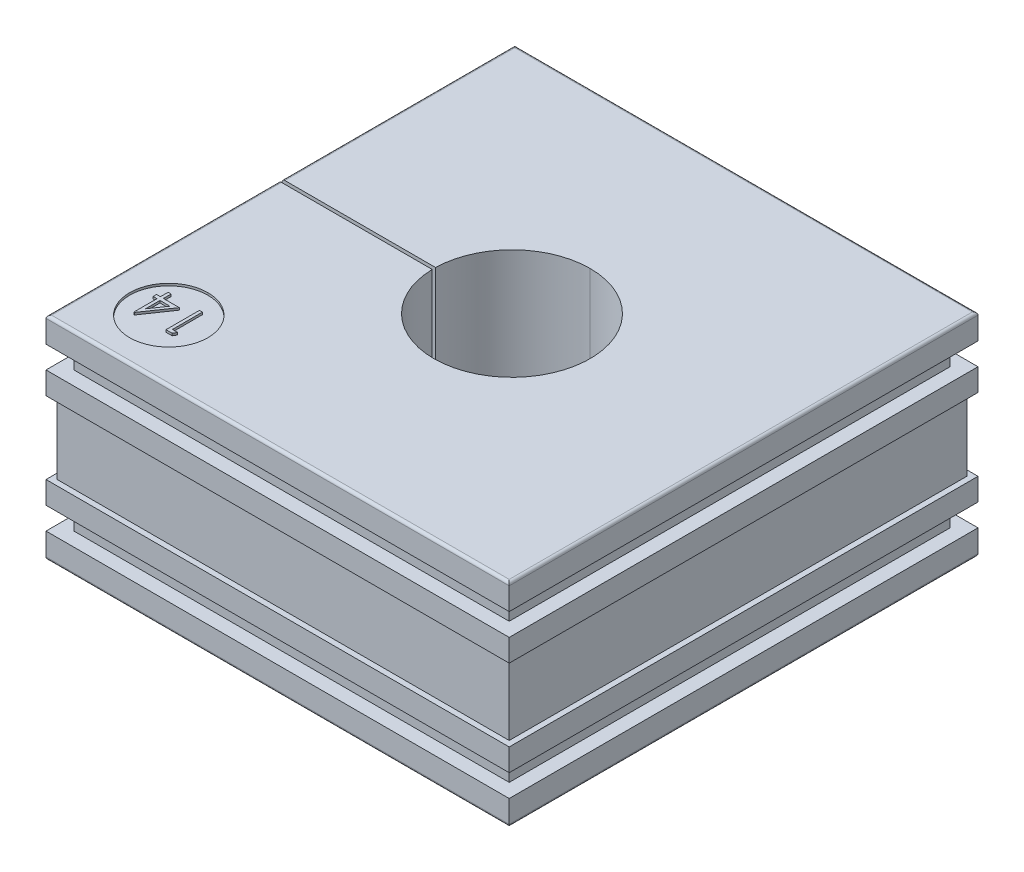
ISO-10303-21;
HEADER;
FILE_DESCRIPTION(('STEP AP214'),'2;1');
FILE_NAME('part.step','',(''),(''),'','','');
FILE_SCHEMA(('AUTOMOTIVE_DESIGN { 1 0 10303 214 1 1 1 1 }'));
ENDSEC;
DATA;
#1=APPLICATION_CONTEXT('core data for automotive mechanical design processes');
#2=APPLICATION_PROTOCOL_DEFINITION('international standard','automotive_design',2000,#1);
#3=PRODUCT_CONTEXT('',#1,'mechanical');
#4=PRODUCT('Part','Part','',(#3));
#5=PRODUCT_RELATED_PRODUCT_CATEGORY('part','',(#4));
#6=PRODUCT_DEFINITION_FORMATION('','',#4);
#7=PRODUCT_DEFINITION_CONTEXT('part definition',#1,'design');
#8=PRODUCT_DEFINITION('design','',#6,#7);
#9=PRODUCT_DEFINITION_SHAPE('','',#8);
#10=(LENGTH_UNIT() NAMED_UNIT(*) SI_UNIT(.MILLI.,.METRE.));
#11=(NAMED_UNIT(*) PLANE_ANGLE_UNIT() SI_UNIT($,.RADIAN.));
#12=(NAMED_UNIT(*) SI_UNIT($,.STERADIAN.) SOLID_ANGLE_UNIT());
#13=UNCERTAINTY_MEASURE_WITH_UNIT(LENGTH_MEASURE(1.E-05),#10,'distance_accuracy_value','');
#14=(GEOMETRIC_REPRESENTATION_CONTEXT(3) GLOBAL_UNCERTAINTY_ASSIGNED_CONTEXT((#13)) GLOBAL_UNIT_ASSIGNED_CONTEXT((#10,
#11,#12)) REPRESENTATION_CONTEXT('',''));
#15=CARTESIAN_POINT('',(0.,0.,0.));
#16=DIRECTION('',(0.,0.,1.));
#17=DIRECTION('',(1.,0.,0.));
#18=AXIS2_PLACEMENT_3D('',#15,#16,#17);
#19=CARTESIAN_POINT('',(-20.75,19.,-21.));
#20=DIRECTION('',(0.,-1.,0.));
#21=DIRECTION('',(0.,0.,-1.));
#22=AXIS2_PLACEMENT_3D('',#19,#20,#21);
#23=PLANE('',#22);
#24=DIRECTION('',(0.496686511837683,0.,-0.86793001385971));
#25=VECTOR('',#24,1.);
#26=CARTESIAN_POINT('',(-13.5192307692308,19.,16.4423076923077));
#27=LINE('',#26,#25);
#28=CARTESIAN_POINT('',(-13.6953125,19.,16.75));
#29=VERTEX_POINT('',#28);
#30=CARTESIAN_POINT('',(-13.5192307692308,19.,16.4423076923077));
#31=VERTEX_POINT('',#30);
#32=EDGE_CURVE('E1118',#29,#31,#27,.T.);
#33=ORIENTED_EDGE('',*,*,#32,.T.);
#34=DIRECTION('',(-1.,0.,0.));
#35=VECTOR('',#34,1.);
#36=CARTESIAN_POINT('',(-13.9807692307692,19.,16.4423076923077));
#37=LINE('',#36,#35);
#38=CARTESIAN_POINT('',(-13.9807692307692,19.,16.4423076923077));
#39=VERTEX_POINT('',#38);
#40=EDGE_CURVE('E1126',#31,#39,#37,.T.);
#41=ORIENTED_EDGE('',*,*,#40,.T.);
#42=DIRECTION('',(0.,0.,-1.));
#43=VECTOR('',#42,1.);
#44=CARTESIAN_POINT('',(-13.9807692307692,19.,13.75));
#45=LINE('',#44,#43);
#46=CARTESIAN_POINT('',(-13.9807692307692,19.,13.75));
#47=VERTEX_POINT('',#46);
#48=EDGE_CURVE('E1133',#39,#47,#45,.T.);
#49=ORIENTED_EDGE('',*,*,#48,.T.);
#50=DIRECTION('',(-1.,0.,0.));
#51=VECTOR('',#50,1.);
#52=CARTESIAN_POINT('',(-14.25,19.,13.75));
#53=LINE('',#52,#51);
#54=CARTESIAN_POINT('',(-14.25,19.,13.75));
#55=VERTEX_POINT('',#54);
#56=EDGE_CURVE('E1140',#47,#55,#53,.T.);
#57=ORIENTED_EDGE('',*,*,#56,.T.);
#58=DIRECTION('',(0.,0.,1.));
#59=VECTOR('',#58,1.);
#60=CARTESIAN_POINT('',(-14.25,19.,16.75));
#61=LINE('',#60,#59);
#62=CARTESIAN_POINT('',(-14.25,19.,16.75));
#63=VERTEX_POINT('',#62);
#64=EDGE_CURVE('E42',#55,#63,#61,.T.);
#65=ORIENTED_EDGE('',*,*,#64,.T.);
#66=DIRECTION('',(1.,0.,0.));
#67=VECTOR('',#66,1.);
#68=CARTESIAN_POINT('',(-13.6953125,19.,16.75));
#69=LINE('',#68,#67);
#70=EDGE_CURVE('E9',#63,#29,#69,.T.);
#71=ORIENTED_EDGE('',*,*,#70,.T.);
#72=EDGE_LOOP('',(#33,#41,#49,#57,#65,#71));
#73=FACE_BOUND('',#72,.T.);
#74=ADVANCED_FACE('F15',(#73),#23,.F.);
#75=CARTESIAN_POINT('',(-13.6953125,22.6909051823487,16.75));
#76=DIRECTION('',(0.,0.,1.));
#77=DIRECTION('',(1.,0.,0.));
#78=AXIS2_PLACEMENT_3D('',#75,#76,#77);
#79=PLANE('',#78);
#80=ORIENTED_EDGE('',*,*,#70,.F.);
#81=DIRECTION('',(0.,-1.,0.));
#82=VECTOR('',#81,1.);
#83=CARTESIAN_POINT('',(-14.25,22.6909051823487,16.75));
#84=LINE('',#83,#82);
#85=CARTESIAN_POINT('',(-14.25,18.8,16.75));
#86=VERTEX_POINT('',#85);
#87=EDGE_CURVE('E24',#63,#86,#84,.T.);
#88=ORIENTED_EDGE('',*,*,#87,.T.);
#89=DIRECTION('',(-1.,0.,0.));
#90=VECTOR('',#89,1.);
#91=CARTESIAN_POINT('',(-13.6953125,18.8,16.75));
#92=LINE('',#91,#90);
#93=CARTESIAN_POINT('',(-13.6953125,18.8,16.75));
#94=VERTEX_POINT('',#93);
#95=EDGE_CURVE('E1153',#94,#86,#92,.T.);
#96=ORIENTED_EDGE('',*,*,#95,.F.);
#97=DIRECTION('',(0.,-1.,0.));
#98=VECTOR('',#97,1.);
#99=CARTESIAN_POINT('',(-13.6953125,22.6909051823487,16.75));
#100=LINE('',#99,#98);
#101=EDGE_CURVE('E1122',#29,#94,#100,.T.);
#102=ORIENTED_EDGE('',*,*,#101,.F.);
#103=EDGE_LOOP('',(#80,#88,#96,#102));
#104=FACE_BOUND('',#103,.T.);
#105=ADVANCED_FACE('F17',(#104),#79,.T.);
#106=CARTESIAN_POINT('',(-14.25,22.6909051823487,16.75));
#107=DIRECTION('',(-1.,0.,0.));
#108=DIRECTION('',(0.,0.,1.));
#109=AXIS2_PLACEMENT_3D('',#106,#107,#108);
#110=PLANE('',#109);
#111=ORIENTED_EDGE('',*,*,#64,.F.);
#112=DIRECTION('',(0.,-1.,0.));
#113=VECTOR('',#112,1.);
#114=CARTESIAN_POINT('',(-14.25,22.6909051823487,13.75));
#115=LINE('',#114,#113);
#116=CARTESIAN_POINT('',(-14.25,18.8,13.75));
#117=VERTEX_POINT('',#116);
#118=EDGE_CURVE('E1144',#55,#117,#115,.T.);
#119=ORIENTED_EDGE('',*,*,#118,.T.);
#120=DIRECTION('',(0.,0.,-1.));
#121=VECTOR('',#120,1.);
#122=CARTESIAN_POINT('',(-14.25,18.8,16.75));
#123=LINE('',#122,#121);
#124=EDGE_CURVE('E1156',#86,#117,#123,.T.);
#125=ORIENTED_EDGE('',*,*,#124,.F.);
#126=ORIENTED_EDGE('',*,*,#87,.F.);
#127=EDGE_LOOP('',(#111,#119,#125,#126));
#128=FACE_BOUND('',#127,.T.);
#129=ADVANCED_FACE('F1157',(#128),#110,.T.);
#130=CARTESIAN_POINT('',(-14.25,22.6909051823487,13.75));
#131=DIRECTION('',(0.,0.,-1.));
#132=DIRECTION('',(0.,-1.,0.));
#133=AXIS2_PLACEMENT_3D('',#130,#131,#132);
#134=PLANE('',#133);
#135=ORIENTED_EDGE('',*,*,#56,.F.);
#136=DIRECTION('',(0.,-1.,0.));
#137=VECTOR('',#136,1.);
#138=CARTESIAN_POINT('',(-13.9807692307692,22.6909051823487,13.75));
#139=LINE('',#138,#137);
#140=CARTESIAN_POINT('',(-13.9807692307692,18.8,13.75));
#141=VERTEX_POINT('',#140);
#142=EDGE_CURVE('E1137',#47,#141,#139,.T.);
#143=ORIENTED_EDGE('',*,*,#142,.T.);
#144=DIRECTION('',(1.,0.,0.));
#145=VECTOR('',#144,1.);
#146=CARTESIAN_POINT('',(-14.25,18.8,13.75));
#147=LINE('',#146,#145);
#148=EDGE_CURVE('E1162',#117,#141,#147,.T.);
#149=ORIENTED_EDGE('',*,*,#148,.F.);
#150=ORIENTED_EDGE('',*,*,#118,.F.);
#151=EDGE_LOOP('',(#135,#143,#149,#150));
#152=FACE_BOUND('',#151,.T.);
#153=ADVANCED_FACE('F2421',(#152),#134,.T.);
#154=CARTESIAN_POINT('',(-13.9807692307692,22.6909051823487,13.75));
#155=DIRECTION('',(1.,0.,0.));
#156=DIRECTION('',(0.,1.,0.));
#157=AXIS2_PLACEMENT_3D('',#154,#155,#156);
#158=PLANE('',#157);
#159=ORIENTED_EDGE('',*,*,#48,.F.);
#160=DIRECTION('',(0.,-1.,0.));
#161=VECTOR('',#160,1.);
#162=CARTESIAN_POINT('',(-13.9807692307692,22.6909051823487,16.4423076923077));
#163=LINE('',#162,#161);
#164=CARTESIAN_POINT('',(-13.9807692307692,18.8,16.4423076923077));
#165=VERTEX_POINT('',#164);
#166=EDGE_CURVE('E1130',#39,#165,#163,.T.);
#167=ORIENTED_EDGE('',*,*,#166,.T.);
#168=DIRECTION('',(0.,0.,1.));
#169=VECTOR('',#168,1.);
#170=CARTESIAN_POINT('',(-13.9807692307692,18.8,13.75));
#171=LINE('',#170,#169);
#172=EDGE_CURVE('E1201',#141,#165,#171,.T.);
#173=ORIENTED_EDGE('',*,*,#172,.F.);
#174=ORIENTED_EDGE('',*,*,#142,.F.);
#175=EDGE_LOOP('',(#159,#167,#173,#174));
#176=FACE_BOUND('',#175,.T.);
#177=ADVANCED_FACE('F2410',(#176),#158,.T.);
#178=CARTESIAN_POINT('',(-13.9807692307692,22.6909051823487,16.4423076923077));
#179=DIRECTION('',(0.,0.,-1.));
#180=DIRECTION('',(0.,-1.,0.));
#181=AXIS2_PLACEMENT_3D('',#178,#179,#180);
#182=PLANE('',#181);
#183=ORIENTED_EDGE('',*,*,#40,.F.);
#184=DIRECTION('',(0.,-1.,0.));
#185=VECTOR('',#184,1.);
#186=CARTESIAN_POINT('',(-13.5192307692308,22.6909051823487,16.4423076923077));
#187=LINE('',#186,#185);
#188=CARTESIAN_POINT('',(-13.5192307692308,18.8,16.4423076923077));
#189=VERTEX_POINT('',#188);
#190=EDGE_CURVE('E1125',#31,#189,#187,.T.);
#191=ORIENTED_EDGE('',*,*,#190,.T.);
#192=DIRECTION('',(1.,0.,0.));
#193=VECTOR('',#192,1.);
#194=CARTESIAN_POINT('',(-13.9807692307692,18.8,16.4423076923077));
#195=LINE('',#194,#193);
#196=EDGE_CURVE('E1274',#165,#189,#195,.T.);
#197=ORIENTED_EDGE('',*,*,#196,.F.);
#198=ORIENTED_EDGE('',*,*,#166,.F.);
#199=EDGE_LOOP('',(#183,#191,#197,#198));
#200=FACE_BOUND('',#199,.T.);
#201=ADVANCED_FACE('F2399',(#200),#182,.T.);
#202=CARTESIAN_POINT('',(-13.5192307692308,22.6909051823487,16.4423076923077));
#203=DIRECTION('',(0.86793001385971,0.,0.496686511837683));
#204=DIRECTION('',(0.,-1.,0.));
#205=AXIS2_PLACEMENT_3D('',#202,#203,#204);
#206=PLANE('',#205);
#207=ORIENTED_EDGE('',*,*,#32,.F.);
#208=ORIENTED_EDGE('',*,*,#101,.T.);
#209=DIRECTION('',(-0.496686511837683,0.,0.86793001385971));
#210=VECTOR('',#209,1.);
#211=CARTESIAN_POINT('',(-13.5192307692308,18.8,16.4423076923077));
#212=LINE('',#211,#210);
#213=EDGE_CURVE('E1168',#189,#94,#212,.T.);
#214=ORIENTED_EDGE('',*,*,#213,.F.);
#215=ORIENTED_EDGE('',*,*,#190,.F.);
#216=EDGE_LOOP('',(#207,#208,#214,#215));
#217=FACE_BOUND('',#216,.T.);
#218=ADVANCED_FACE('F2388',(#217),#206,.T.);
#219=CARTESIAN_POINT('',(-15.25,18.8,15.5));
#220=DIRECTION('',(0.,1.,0.));
#221=DIRECTION('',(1.,0.,0.));
#222=AXIS2_PLACEMENT_3D('',#219,#220,#221);
#223=PLANE('',#222);
#224=DIRECTION('',(-1.,0.,0.));
#225=VECTOR('',#224,1.);
#226=CARTESIAN_POINT('',(-15.8942307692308,18.8,14.75));
#227=LINE('',#226,#225);
#228=CARTESIAN_POINT('',(-15.8942307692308,18.8,14.75));
#229=VERTEX_POINT('',#228);
#230=CARTESIAN_POINT('',(-16.7884615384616,18.8,14.75));
#231=VERTEX_POINT('',#230);
#232=EDGE_CURVE('E1457',#229,#231,#227,.T.);
#233=ORIENTED_EDGE('',*,*,#232,.T.);
#234=DIRECTION('',(0.,0.,1.));
#235=VECTOR('',#234,1.);
#236=CARTESIAN_POINT('',(-16.7884615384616,18.8,14.75));
#237=LINE('',#236,#235);
#238=CARTESIAN_POINT('',(-16.7884615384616,18.8,16.0528846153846));
#239=VERTEX_POINT('',#238);
#240=EDGE_CURVE('E1108',#231,#239,#237,.T.);
#241=ORIENTED_EDGE('',*,*,#240,.T.);
#242=DIRECTION('',(0.565883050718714,0.,-0.824485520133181));
#243=VECTOR('',#242,1.);
#244=CARTESIAN_POINT('',(-16.7884615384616,18.8,16.0528846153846));
#245=LINE('',#244,#243);
#246=EDGE_CURVE('E1115',#239,#229,#245,.T.);
#247=ORIENTED_EDGE('',*,*,#246,.T.);
#248=EDGE_LOOP('',(#233,#241,#247));
#249=FACE_BOUND('',#248,.T.);
#250=ADVANCED_FACE('F2378',(#249),#223,.T.);
#251=CARTESIAN_POINT('',(-20.75,19.,-21.));
#252=DIRECTION('',(0.,-1.,0.));
#253=DIRECTION('',(0.,0.,-1.));
#254=AXIS2_PLACEMENT_3D('',#251,#252,#253);
#255=PLANE('',#254);
#256=DIRECTION('',(1.,0.,0.));
#257=VECTOR('',#256,1.);
#258=CARTESIAN_POINT('',(-15.8942307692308,19.,14.75));
#259=LINE('',#258,#257);
#260=CARTESIAN_POINT('',(-16.7884615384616,19.,14.75));
#261=VERTEX_POINT('',#260);
#262=CARTESIAN_POINT('',(-15.8942307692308,19.,14.75));
#263=VERTEX_POINT('',#262);
#264=EDGE_CURVE('E1099',#261,#263,#259,.T.);
#265=ORIENTED_EDGE('',*,*,#264,.T.);
#266=DIRECTION('',(-0.565883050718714,0.,0.824485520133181));
#267=VECTOR('',#266,1.);
#268=CARTESIAN_POINT('',(-16.7884615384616,19.,16.0528846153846));
#269=LINE('',#268,#267);
#270=CARTESIAN_POINT('',(-16.7884615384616,19.,16.0528846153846));
#271=VERTEX_POINT('',#270);
#272=EDGE_CURVE('E1112',#263,#271,#269,.T.);
#273=ORIENTED_EDGE('',*,*,#272,.T.);
#274=DIRECTION('',(0.,0.,-1.));
#275=VECTOR('',#274,1.);
#276=CARTESIAN_POINT('',(-16.7884615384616,19.,14.75));
#277=LINE('',#276,#275);
#278=EDGE_CURVE('E1100',#271,#261,#277,.T.);
#279=ORIENTED_EDGE('',*,*,#278,.T.);
#280=EDGE_LOOP('',(#265,#273,#279));
#281=FACE_BOUND('',#280,.T.);
#282=DIRECTION('',(0.566105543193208,0.,-0.824332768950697));
#283=VECTOR('',#282,1.);
#284=CARTESIAN_POINT('',(-15.3653846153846,19.,14.4423076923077));
#285=LINE('',#284,#283);
#286=CARTESIAN_POINT('',(-17.0030048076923,19.,16.826923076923));
#287=VERTEX_POINT('',#286);
#288=CARTESIAN_POINT('',(-15.3653846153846,19.,14.4423076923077));
#289=VERTEX_POINT('',#288);
#290=EDGE_CURVE('E1033',#287,#289,#285,.T.);
#291=ORIENTED_EDGE('',*,*,#290,.T.);
#292=DIRECTION('',(-1.,0.,0.));
#293=VECTOR('',#292,1.);
#294=CARTESIAN_POINT('',(-16.7884615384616,19.,14.4423076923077));
#295=LINE('',#294,#293);
#296=CARTESIAN_POINT('',(-16.7884615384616,19.,14.4423076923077));
#297=VERTEX_POINT('',#296);
#298=EDGE_CURVE('E1046',#289,#297,#295,.T.);
#299=ORIENTED_EDGE('',*,*,#298,.T.);
#300=DIRECTION('',(0.,0.,-1.));
#301=VECTOR('',#300,1.);
#302=CARTESIAN_POINT('',(-16.7884615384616,19.,13.75));
#303=LINE('',#302,#301);
#304=CARTESIAN_POINT('',(-16.7884615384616,19.,13.75));
#305=VERTEX_POINT('',#304);
#306=EDGE_CURVE('E1053',#297,#305,#303,.T.);
#307=ORIENTED_EDGE('',*,*,#306,.T.);
#308=DIRECTION('',(-1.,0.,0.));
#309=VECTOR('',#308,1.);
#310=CARTESIAN_POINT('',(-17.0576923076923,19.,13.75));
#311=LINE('',#310,#309);
#312=CARTESIAN_POINT('',(-17.0576923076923,19.,13.75));
#313=VERTEX_POINT('',#312);
#314=EDGE_CURVE('E1060',#305,#313,#311,.T.);
#315=ORIENTED_EDGE('',*,*,#314,.T.);
#316=DIRECTION('',(0.,0.,1.));
#317=VECTOR('',#316,1.);
#318=CARTESIAN_POINT('',(-17.0576923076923,19.,14.4423076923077));
#319=LINE('',#318,#317);
#320=CARTESIAN_POINT('',(-17.0576923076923,19.,14.4423076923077));
#321=VERTEX_POINT('',#320);
#322=EDGE_CURVE('E1064',#313,#321,#319,.T.);
#323=ORIENTED_EDGE('',*,*,#322,.T.);
#324=DIRECTION('',(-1.,0.,0.));
#325=VECTOR('',#324,1.);
#326=CARTESIAN_POINT('',(-17.4038461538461,19.,14.4423076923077));
#327=LINE('',#326,#325);
#328=CARTESIAN_POINT('',(-17.4038461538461,19.,14.4423076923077));
#329=VERTEX_POINT('',#328);
#330=EDGE_CURVE('E1071',#321,#329,#327,.T.);
#331=ORIENTED_EDGE('',*,*,#330,.T.);
#332=DIRECTION('',(0.,0.,1.));
#333=VECTOR('',#332,1.);
#334=CARTESIAN_POINT('',(-17.4038461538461,19.,14.75));
#335=LINE('',#334,#333);
#336=CARTESIAN_POINT('',(-17.4038461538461,19.,14.75));
#337=VERTEX_POINT('',#336);
#338=EDGE_CURVE('E1078',#329,#337,#335,.T.);
#339=ORIENTED_EDGE('',*,*,#338,.T.);
#340=DIRECTION('',(1.,0.,0.));
#341=VECTOR('',#340,1.);
#342=CARTESIAN_POINT('',(-17.0576923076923,19.,14.75));
#343=LINE('',#342,#341);
#344=CARTESIAN_POINT('',(-17.0576923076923,19.,14.75));
#345=VERTEX_POINT('',#344);
#346=EDGE_CURVE('E1085',#337,#345,#343,.T.);
#347=ORIENTED_EDGE('',*,*,#346,.T.);
#348=DIRECTION('',(0.,0.,1.));
#349=VECTOR('',#348,1.);
#350=CARTESIAN_POINT('',(-17.0576923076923,19.,16.826923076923));
#351=LINE('',#350,#349);
#352=CARTESIAN_POINT('',(-17.0576923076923,19.,16.826923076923));
#353=VERTEX_POINT('',#352);
#354=EDGE_CURVE('E1089',#345,#353,#351,.T.);
#355=ORIENTED_EDGE('',*,*,#354,.T.);
#356=DIRECTION('',(1.,0.,0.));
#357=VECTOR('',#356,1.);
#358=CARTESIAN_POINT('',(-17.0030048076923,19.,16.826923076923));
#359=LINE('',#358,#357);
#360=EDGE_CURVE('E1096',#353,#287,#359,.T.);
#361=ORIENTED_EDGE('',*,*,#360,.T.);
#362=EDGE_LOOP('',(#291,#299,#307,#315,#323,#331,#339,#347,#355,#361));
#363=FACE_BOUND('',#362,.T.);
#364=ADVANCED_FACE('F2367',(#281,#363),#255,.F.);
#365=CARTESIAN_POINT('',(-16.7884615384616,22.6909051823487,16.0528846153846));
#366=DIRECTION('',(-0.824485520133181,0.,-0.565883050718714));
#367=DIRECTION('',(-0.565883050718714,0.,0.824485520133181));
#368=AXIS2_PLACEMENT_3D('',#365,#366,#367);
#369=PLANE('',#368);
#370=ORIENTED_EDGE('',*,*,#272,.F.);
#371=DIRECTION('',(0.,-1.,0.));
#372=VECTOR('',#371,1.);
#373=CARTESIAN_POINT('',(-15.8942307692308,22.6909051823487,14.75));
#374=LINE('',#373,#372);
#375=EDGE_CURVE('E1104',#263,#229,#374,.T.);
#376=ORIENTED_EDGE('',*,*,#375,.T.);
#377=ORIENTED_EDGE('',*,*,#246,.F.);
#378=DIRECTION('',(0.,-1.,0.));
#379=VECTOR('',#378,1.);
#380=CARTESIAN_POINT('',(-16.7884615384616,22.6909051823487,16.0528846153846));
#381=LINE('',#380,#379);
#382=EDGE_CURVE('E1103',#271,#239,#381,.T.);
#383=ORIENTED_EDGE('',*,*,#382,.F.);
#384=EDGE_LOOP('',(#370,#376,#377,#383));
#385=FACE_BOUND('',#384,.T.);
#386=ADVANCED_FACE('F1616',(#385),#369,.T.);
#387=CARTESIAN_POINT('',(-16.7884615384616,22.6909051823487,14.75));
#388=DIRECTION('',(1.,0.,0.));
#389=DIRECTION('',(0.,1.,0.));
#390=AXIS2_PLACEMENT_3D('',#387,#388,#389);
#391=PLANE('',#390);
#392=ORIENTED_EDGE('',*,*,#278,.F.);
#393=ORIENTED_EDGE('',*,*,#382,.T.);
#394=ORIENTED_EDGE('',*,*,#240,.F.);
#395=DIRECTION('',(0.,-1.,0.));
#396=VECTOR('',#395,1.);
#397=CARTESIAN_POINT('',(-16.7884615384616,22.6909051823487,14.75));
#398=LINE('',#397,#396);
#399=EDGE_CURVE('E1270',#261,#231,#398,.T.);
#400=ORIENTED_EDGE('',*,*,#399,.F.);
#401=EDGE_LOOP('',(#392,#393,#394,#400));
#402=FACE_BOUND('',#401,.T.);
#403=ADVANCED_FACE('F1612',(#402),#391,.T.);
#404=CARTESIAN_POINT('',(-15.8942307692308,22.6909051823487,14.75));
#405=DIRECTION('',(0.,0.,1.));
#406=DIRECTION('',(1.,0.,0.));
#407=AXIS2_PLACEMENT_3D('',#404,#405,#406);
#408=PLANE('',#407);
#409=ORIENTED_EDGE('',*,*,#264,.F.);
#410=ORIENTED_EDGE('',*,*,#399,.T.);
#411=ORIENTED_EDGE('',*,*,#232,.F.);
#412=ORIENTED_EDGE('',*,*,#375,.F.);
#413=EDGE_LOOP('',(#409,#410,#411,#412));
#414=FACE_BOUND('',#413,.T.);
#415=ADVANCED_FACE('F1615',(#414),#408,.T.);
#416=CARTESIAN_POINT('',(-17.0030048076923,22.6909051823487,16.826923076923));
#417=DIRECTION('',(0.,0.,1.));
#418=DIRECTION('',(1.,0.,0.));
#419=AXIS2_PLACEMENT_3D('',#416,#417,#418);
#420=PLANE('',#419);
#421=ORIENTED_EDGE('',*,*,#360,.F.);
#422=DIRECTION('',(0.,-1.,0.));
#423=VECTOR('',#422,1.);
#424=CARTESIAN_POINT('',(-17.0576923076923,22.6909051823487,16.826923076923));
#425=LINE('',#424,#423);
#426=CARTESIAN_POINT('',(-17.0576923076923,18.8,16.826923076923));
#427=VERTEX_POINT('',#426);
#428=EDGE_CURVE('E1093',#353,#427,#425,.T.);
#429=ORIENTED_EDGE('',*,*,#428,.T.);
#430=DIRECTION('',(-1.,0.,0.));
#431=VECTOR('',#430,1.);
#432=CARTESIAN_POINT('',(-17.0030048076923,18.8,16.826923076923));
#433=LINE('',#432,#431);
#434=CARTESIAN_POINT('',(-17.0030048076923,18.8,16.826923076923));
#435=VERTEX_POINT('',#434);
#436=EDGE_CURVE('E1284',#435,#427,#433,.T.);
#437=ORIENTED_EDGE('',*,*,#436,.F.);
#438=DIRECTION('',(0.,-1.,0.));
#439=VECTOR('',#438,1.);
#440=CARTESIAN_POINT('',(-17.0030048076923,22.6909051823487,16.826923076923));
#441=LINE('',#440,#439);
#442=EDGE_CURVE('E1040',#287,#435,#441,.T.);
#443=ORIENTED_EDGE('',*,*,#442,.F.);
#444=EDGE_LOOP('',(#421,#429,#437,#443));
#445=FACE_BOUND('',#444,.T.);
#446=ADVANCED_FACE('F2332',(#445),#420,.T.);
#447=CARTESIAN_POINT('',(-17.0576923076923,22.6909051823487,16.826923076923));
#448=DIRECTION('',(-1.,0.,0.));
#449=DIRECTION('',(0.,0.,1.));
#450=AXIS2_PLACEMENT_3D('',#447,#448,#449);
#451=PLANE('',#450);
#452=ORIENTED_EDGE('',*,*,#354,.F.);
#453=DIRECTION('',(0.,-1.,0.));
#454=VECTOR('',#453,1.);
#455=CARTESIAN_POINT('',(-17.0576923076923,22.6909051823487,14.75));
#456=LINE('',#455,#454);
#457=CARTESIAN_POINT('',(-17.0576923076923,18.8,14.75));
#458=VERTEX_POINT('',#457);
#459=EDGE_CURVE('E1086',#345,#458,#456,.T.);
#460=ORIENTED_EDGE('',*,*,#459,.T.);
#461=DIRECTION('',(0.,0.,-1.));
#462=VECTOR('',#461,1.);
#463=CARTESIAN_POINT('',(-17.0576923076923,18.8,16.826923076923));
#464=LINE('',#463,#462);
#465=EDGE_CURVE('E1288',#427,#458,#464,.T.);
#466=ORIENTED_EDGE('',*,*,#465,.F.);
#467=ORIENTED_EDGE('',*,*,#428,.F.);
#468=EDGE_LOOP('',(#452,#460,#466,#467));
#469=FACE_BOUND('',#468,.T.);
#470=ADVANCED_FACE('F2322',(#469),#451,.T.);
#471=CARTESIAN_POINT('',(-17.0576923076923,22.6909051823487,14.75));
#472=DIRECTION('',(0.,0.,1.));
#473=DIRECTION('',(1.,0.,0.));
#474=AXIS2_PLACEMENT_3D('',#471,#472,#473);
#475=PLANE('',#474);
#476=ORIENTED_EDGE('',*,*,#346,.F.);
#477=DIRECTION('',(0.,-1.,0.));
#478=VECTOR('',#477,1.);
#479=CARTESIAN_POINT('',(-17.4038461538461,22.6909051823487,14.75));
#480=LINE('',#479,#478);
#481=CARTESIAN_POINT('',(-17.4038461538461,18.8,14.75));
#482=VERTEX_POINT('',#481);
#483=EDGE_CURVE('E1082',#337,#482,#480,.T.);
#484=ORIENTED_EDGE('',*,*,#483,.T.);
#485=DIRECTION('',(-1.,0.,0.));
#486=VECTOR('',#485,1.);
#487=CARTESIAN_POINT('',(-17.0576923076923,18.8,14.75));
#488=LINE('',#487,#486);
#489=EDGE_CURVE('E1295',#458,#482,#488,.T.);
#490=ORIENTED_EDGE('',*,*,#489,.F.);
#491=ORIENTED_EDGE('',*,*,#459,.F.);
#492=EDGE_LOOP('',(#476,#484,#490,#491));
#493=FACE_BOUND('',#492,.T.);
#494=ADVANCED_FACE('F2313',(#493),#475,.T.);
#495=CARTESIAN_POINT('',(-17.4038461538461,22.6909051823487,14.75));
#496=DIRECTION('',(-1.,0.,0.));
#497=DIRECTION('',(0.,0.,1.));
#498=AXIS2_PLACEMENT_3D('',#495,#496,#497);
#499=PLANE('',#498);
#500=ORIENTED_EDGE('',*,*,#338,.F.);
#501=DIRECTION('',(0.,-1.,0.));
#502=VECTOR('',#501,1.);
#503=CARTESIAN_POINT('',(-17.4038461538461,22.6909051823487,14.4423076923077));
#504=LINE('',#503,#502);
#505=CARTESIAN_POINT('',(-17.4038461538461,18.8,14.4423076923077));
#506=VERTEX_POINT('',#505);
#507=EDGE_CURVE('E1075',#329,#506,#504,.T.);
#508=ORIENTED_EDGE('',*,*,#507,.T.);
#509=DIRECTION('',(0.,0.,-1.));
#510=VECTOR('',#509,1.);
#511=CARTESIAN_POINT('',(-17.4038461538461,18.8,14.75));
#512=LINE('',#511,#510);
#513=EDGE_CURVE('E1253',#482,#506,#512,.T.);
#514=ORIENTED_EDGE('',*,*,#513,.F.);
#515=ORIENTED_EDGE('',*,*,#483,.F.);
#516=EDGE_LOOP('',(#500,#508,#514,#515));
#517=FACE_BOUND('',#516,.T.);
#518=ADVANCED_FACE('F2302',(#517),#499,.T.);
#519=CARTESIAN_POINT('',(-17.4038461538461,22.6909051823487,14.4423076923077));
#520=DIRECTION('',(0.,0.,-1.));
#521=DIRECTION('',(0.,-1.,0.));
#522=AXIS2_PLACEMENT_3D('',#519,#520,#521);
#523=PLANE('',#522);
#524=ORIENTED_EDGE('',*,*,#330,.F.);
#525=DIRECTION('',(0.,-1.,0.));
#526=VECTOR('',#525,1.);
#527=CARTESIAN_POINT('',(-17.0576923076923,22.6909051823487,14.4423076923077));
#528=LINE('',#527,#526);
#529=CARTESIAN_POINT('',(-17.0576923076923,18.8,14.4423076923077));
#530=VERTEX_POINT('',#529);
#531=EDGE_CURVE('E1068',#321,#530,#528,.T.);
#532=ORIENTED_EDGE('',*,*,#531,.T.);
#533=DIRECTION('',(1.,0.,0.));
#534=VECTOR('',#533,1.);
#535=CARTESIAN_POINT('',(-17.4038461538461,18.8,14.4423076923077));
#536=LINE('',#535,#534);
#537=EDGE_CURVE('E1248',#506,#530,#536,.T.);
#538=ORIENTED_EDGE('',*,*,#537,.F.);
#539=ORIENTED_EDGE('',*,*,#507,.F.);
#540=EDGE_LOOP('',(#524,#532,#538,#539));
#541=FACE_BOUND('',#540,.T.);
#542=ADVANCED_FACE('F2291',(#541),#523,.T.);
#543=CARTESIAN_POINT('',(-17.0576923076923,22.6909051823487,14.4423076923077));
#544=DIRECTION('',(-1.,0.,0.));
#545=DIRECTION('',(0.,0.,1.));
#546=AXIS2_PLACEMENT_3D('',#543,#544,#545);
#547=PLANE('',#546);
#548=ORIENTED_EDGE('',*,*,#322,.F.);
#549=DIRECTION('',(0.,-1.,0.));
#550=VECTOR('',#549,1.);
#551=CARTESIAN_POINT('',(-17.0576923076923,22.6909051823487,13.75));
#552=LINE('',#551,#550);
#553=CARTESIAN_POINT('',(-17.0576923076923,18.8,13.75));
#554=VERTEX_POINT('',#553);
#555=EDGE_CURVE('E1061',#313,#554,#552,.T.);
#556=ORIENTED_EDGE('',*,*,#555,.T.);
#557=DIRECTION('',(0.,0.,-1.));
#558=VECTOR('',#557,1.);
#559=CARTESIAN_POINT('',(-17.0576923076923,18.8,14.4423076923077));
#560=LINE('',#559,#558);
#561=EDGE_CURVE('E1252',#530,#554,#560,.T.);
#562=ORIENTED_EDGE('',*,*,#561,.F.);
#563=ORIENTED_EDGE('',*,*,#531,.F.);
#564=EDGE_LOOP('',(#548,#556,#562,#563));
#565=FACE_BOUND('',#564,.T.);
#566=ADVANCED_FACE('F2280',(#565),#547,.T.);
#567=CARTESIAN_POINT('',(-17.0576923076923,22.6909051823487,13.75));
#568=DIRECTION('',(0.,0.,-1.));
#569=DIRECTION('',(0.,-1.,0.));
#570=AXIS2_PLACEMENT_3D('',#567,#568,#569);
#571=PLANE('',#570);
#572=ORIENTED_EDGE('',*,*,#314,.F.);
#573=DIRECTION('',(0.,-1.,0.));
#574=VECTOR('',#573,1.);
#575=CARTESIAN_POINT('',(-16.7884615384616,22.6909051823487,13.75));
#576=LINE('',#575,#574);
#577=CARTESIAN_POINT('',(-16.7884615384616,18.8,13.75));
#578=VERTEX_POINT('',#577);
#579=EDGE_CURVE('E1057',#305,#578,#576,.T.);
#580=ORIENTED_EDGE('',*,*,#579,.T.);
#581=DIRECTION('',(1.,0.,0.));
#582=VECTOR('',#581,1.);
#583=CARTESIAN_POINT('',(-17.0576923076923,18.8,13.75));
#584=LINE('',#583,#582);
#585=EDGE_CURVE('E1316',#554,#578,#584,.T.);
#586=ORIENTED_EDGE('',*,*,#585,.F.);
#587=ORIENTED_EDGE('',*,*,#555,.F.);
#588=EDGE_LOOP('',(#572,#580,#586,#587));
#589=FACE_BOUND('',#588,.T.);
#590=ADVANCED_FACE('F2269',(#589),#571,.T.);
#591=CARTESIAN_POINT('',(-16.7884615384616,22.6909051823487,13.75));
#592=DIRECTION('',(1.,0.,0.));
#593=DIRECTION('',(0.,1.,0.));
#594=AXIS2_PLACEMENT_3D('',#591,#592,#593);
#595=PLANE('',#594);
#596=ORIENTED_EDGE('',*,*,#306,.F.);
#597=DIRECTION('',(0.,-1.,0.));
#598=VECTOR('',#597,1.);
#599=CARTESIAN_POINT('',(-16.7884615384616,22.6909051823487,14.4423076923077));
#600=LINE('',#599,#598);
#601=CARTESIAN_POINT('',(-16.7884615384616,18.8,14.4423076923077));
#602=VERTEX_POINT('',#601);
#603=EDGE_CURVE('E1050',#297,#602,#600,.T.);
#604=ORIENTED_EDGE('',*,*,#603,.T.);
#605=DIRECTION('',(0.,0.,1.));
#606=VECTOR('',#605,1.);
#607=CARTESIAN_POINT('',(-16.7884615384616,18.8,13.75));
#608=LINE('',#607,#606);
#609=EDGE_CURVE('E1325',#578,#602,#608,.T.);
#610=ORIENTED_EDGE('',*,*,#609,.F.);
#611=ORIENTED_EDGE('',*,*,#579,.F.);
#612=EDGE_LOOP('',(#596,#604,#610,#611));
#613=FACE_BOUND('',#612,.T.);
#614=ADVANCED_FACE('F2258',(#613),#595,.T.);
#615=CARTESIAN_POINT('',(-16.7884615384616,22.6909051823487,14.4423076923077));
#616=DIRECTION('',(0.,0.,-1.));
#617=DIRECTION('',(0.,-1.,0.));
#618=AXIS2_PLACEMENT_3D('',#615,#616,#617);
#619=PLANE('',#618);
#620=ORIENTED_EDGE('',*,*,#298,.F.);
#621=DIRECTION('',(0.,-1.,0.));
#622=VECTOR('',#621,1.);
#623=CARTESIAN_POINT('',(-15.3653846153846,22.6909051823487,14.4423076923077));
#624=LINE('',#623,#622);
#625=CARTESIAN_POINT('',(-15.3653846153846,18.8,14.4423076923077));
#626=VERTEX_POINT('',#625);
#627=EDGE_CURVE('E1043',#289,#626,#624,.T.);
#628=ORIENTED_EDGE('',*,*,#627,.T.);
#629=DIRECTION('',(1.,0.,0.));
#630=VECTOR('',#629,1.);
#631=CARTESIAN_POINT('',(-16.7884615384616,18.8,14.4423076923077));
#632=LINE('',#631,#630);
#633=EDGE_CURVE('E1333',#602,#626,#632,.T.);
#634=ORIENTED_EDGE('',*,*,#633,.F.);
#635=ORIENTED_EDGE('',*,*,#603,.F.);
#636=EDGE_LOOP('',(#620,#628,#634,#635));
#637=FACE_BOUND('',#636,.T.);
#638=ADVANCED_FACE('F2247',(#637),#619,.T.);
#639=CARTESIAN_POINT('',(-15.3653846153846,22.6909051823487,14.4423076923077));
#640=DIRECTION('',(0.824332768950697,0.,0.566105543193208));
#641=DIRECTION('',(0.,-1.,0.));
#642=AXIS2_PLACEMENT_3D('',#639,#640,#641);
#643=PLANE('',#642);
#644=ORIENTED_EDGE('',*,*,#290,.F.);
#645=ORIENTED_EDGE('',*,*,#442,.T.);
#646=DIRECTION('',(-0.566105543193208,0.,0.824332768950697));
#647=VECTOR('',#646,1.);
#648=CARTESIAN_POINT('',(-15.3653846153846,18.8,14.4423076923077));
#649=LINE('',#648,#647);
#650=EDGE_CURVE('E1280',#626,#435,#649,.T.);
#651=ORIENTED_EDGE('',*,*,#650,.F.);
#652=ORIENTED_EDGE('',*,*,#627,.F.);
#653=EDGE_LOOP('',(#644,#645,#651,#652));
#654=FACE_BOUND('',#653,.T.);
#655=ADVANCED_FACE('F2235',(#654),#643,.T.);
#656=CARTESIAN_POINT('',(-15.25,18.8,15.5));
#657=DIRECTION('',(0.,1.,0.));
#658=DIRECTION('',(0.,0.,1.));
#659=AXIS2_PLACEMENT_3D('',#656,#657,#658);
#660=CYLINDRICAL_SURFACE('',#659,3.5);
#661=DIRECTION('',(0.,1.,0.));
#662=VECTOR('',#661,1.);
#663=CARTESIAN_POINT('',(-15.25,18.8,12.));
#664=LINE('',#663,#662);
#665=CARTESIAN_POINT('',(-15.25,18.8,12.));
#666=VERTEX_POINT('',#665);
#667=CARTESIAN_POINT('',(-15.25,19.,12.));
#668=VERTEX_POINT('',#667);
#669=EDGE_CURVE('E1180',#666,#668,#664,.T.);
#670=ORIENTED_EDGE('',*,*,#669,.F.);
#671=CARTESIAN_POINT('',(-15.25,18.8,15.5));
#672=DIRECTION('',(0.,1.,0.));
#673=DIRECTION('',(0.,0.,1.));
#674=AXIS2_PLACEMENT_3D('',#671,#672,#673);
#675=CIRCLE('',#674,3.5);
#676=CARTESIAN_POINT('',(-15.25,18.8,19.));
#677=VERTEX_POINT('',#676);
#678=EDGE_CURVE('E1175',#677,#666,#675,.T.);
#679=ORIENTED_EDGE('',*,*,#678,.F.);
#680=DIRECTION('',(0.,1.,0.));
#681=VECTOR('',#680,1.);
#682=CARTESIAN_POINT('',(-15.25,18.8,19.));
#683=LINE('',#682,#681);
#684=CARTESIAN_POINT('',(-15.25,19.,19.));
#685=VERTEX_POINT('',#684);
#686=EDGE_CURVE('E1195',#677,#685,#683,.T.);
#687=ORIENTED_EDGE('',*,*,#686,.T.);
#688=CARTESIAN_POINT('',(-15.25,19.,15.5));
#689=DIRECTION('',(0.,1.,0.));
#690=DIRECTION('',(0.,0.,1.));
#691=AXIS2_PLACEMENT_3D('',#688,#689,#690);
#692=CIRCLE('',#691,3.5);
#693=EDGE_CURVE('E963',#685,#668,#692,.T.);
#694=ORIENTED_EDGE('',*,*,#693,.T.);
#695=EDGE_LOOP('',(#670,#679,#687,#694));
#696=FACE_BOUND('',#695,.T.);
#697=ADVANCED_FACE('F1600',(#696),#660,.F.);
#698=CARTESIAN_POINT('',(-20.5,18.75,-21.));
#699=DIRECTION('',(0.,0.,1.));
#700=DIRECTION('',(1.,0.,0.));
#701=AXIS2_PLACEMENT_3D('',#698,#699,#700);
#702=CYLINDRICAL_SURFACE('',#701,0.25);
#703=CARTESIAN_POINT('',(-20.5,18.75,0.15));
#704=DIRECTION('',(0.,0.,-1.));
#705=DIRECTION('',(-1.,0.,0.));
#706=AXIS2_PLACEMENT_3D('',#703,#704,#705);
#707=CIRCLE('',#706,0.25);
#708=CARTESIAN_POINT('',(-20.75,18.75,0.15));
#709=VERTEX_POINT('',#708);
#710=CARTESIAN_POINT('',(-20.5,19.,0.15));
#711=VERTEX_POINT('',#710);
#712=EDGE_CURVE('E972',#709,#711,#707,.T.);
#713=ORIENTED_EDGE('',*,*,#712,.F.);
#714=DIRECTION('',(0.,0.,-1.));
#715=VECTOR('',#714,1.);
#716=CARTESIAN_POINT('',(-20.75,18.75,21.));
#717=LINE('',#716,#715);
#718=CARTESIAN_POINT('',(-20.75,18.75,21.));
#719=VERTEX_POINT('',#718);
#720=EDGE_CURVE('E1453',#719,#709,#717,.T.);
#721=ORIENTED_EDGE('',*,*,#720,.F.);
#722=CARTESIAN_POINT('',(-20.75,18.75,21.));
#723=CARTESIAN_POINT('',(-20.75,18.8964466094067,21.));
#724=CARTESIAN_POINT('',(-20.6464466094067,19.,20.8964466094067));
#725=CARTESIAN_POINT('',(-20.5,19.,20.75));
#726=(BOUNDED_CURVE() B_SPLINE_CURVE(3,(#722,#723,#724,#725),.UNSPECIFIED.,.F.,
.F.) B_SPLINE_CURVE_WITH_KNOTS((4,4),(3.1415926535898,4.71238898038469),
.UNSPECIFIED.) CURVE() GEOMETRIC_REPRESENTATION_ITEM() RATIONAL_B_SPLINE_CURVE((1.,
0.804737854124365,0.804737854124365,1.)) REPRESENTATION_ITEM(''));
#727=CARTESIAN_POINT('',(-20.5,19.,20.75));
#728=VERTEX_POINT('',#727);
#729=EDGE_CURVE('E1025',#719,#728,#726,.T.);
#730=ORIENTED_EDGE('',*,*,#729,.T.);
#731=DIRECTION('',(0.,0.,1.));
#732=VECTOR('',#731,1.);
#733=CARTESIAN_POINT('',(-20.5,19.,-21.));
#734=LINE('',#733,#732);
#735=EDGE_CURVE('E936',#711,#728,#734,.T.);
#736=ORIENTED_EDGE('',*,*,#735,.F.);
#737=EDGE_LOOP('',(#713,#721,#730,#736));
#738=FACE_BOUND('',#737,.T.);
#739=ADVANCED_FACE('F1596',(#738),#702,.T.);
#740=CARTESIAN_POINT('',(-20.75,18.75,20.75));
#741=DIRECTION('',(1.,0.,0.));
#742=DIRECTION('',(0.,0.,-1.));
#743=AXIS2_PLACEMENT_3D('',#740,#741,#742);
#744=CYLINDRICAL_SURFACE('',#743,0.25);
#745=CARTESIAN_POINT('',(20.75,18.75,21.));
#746=CARTESIAN_POINT('',(20.75,18.8964466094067,21.));
#747=CARTESIAN_POINT('',(20.6464466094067,19.,20.8964466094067));
#748=CARTESIAN_POINT('',(20.5,19.,20.75));
#749=(BOUNDED_CURVE() B_SPLINE_CURVE(3,(#745,#746,#747,#748),.UNSPECIFIED.,.F.,
.F.) B_SPLINE_CURVE_WITH_KNOTS((4,4),(0.,1.5707963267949),
.UNSPECIFIED.) CURVE() GEOMETRIC_REPRESENTATION_ITEM() RATIONAL_B_SPLINE_CURVE((1.,
0.804737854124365,0.804737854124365,1.)) REPRESENTATION_ITEM(''));
#750=CARTESIAN_POINT('',(20.75,18.75,21.));
#751=VERTEX_POINT('',#750);
#752=CARTESIAN_POINT('',(20.5,19.,20.75));
#753=VERTEX_POINT('',#752);
#754=EDGE_CURVE('E1024',#751,#753,#749,.T.);
#755=ORIENTED_EDGE('',*,*,#754,.T.);
#756=DIRECTION('',(1.,0.,0.));
#757=VECTOR('',#756,1.);
#758=CARTESIAN_POINT('',(-20.75,19.,20.75));
#759=LINE('',#758,#757);
#760=EDGE_CURVE('E940',#728,#753,#759,.T.);
#761=ORIENTED_EDGE('',*,*,#760,.F.);
#762=ORIENTED_EDGE('',*,*,#729,.F.);
#763=DIRECTION('',(-1.,0.,0.));
#764=VECTOR('',#763,1.);
#765=CARTESIAN_POINT('',(-20.75,18.75,21.));
#766=LINE('',#765,#764);
#767=EDGE_CURVE('E731',#751,#719,#766,.T.);
#768=ORIENTED_EDGE('',*,*,#767,.F.);
#769=EDGE_LOOP('',(#755,#761,#762,#768));
#770=FACE_BOUND('',#769,.T.);
#771=ADVANCED_FACE('F1599',(#770),#744,.T.);
#772=CARTESIAN_POINT('',(20.5,18.75,-21.));
#773=DIRECTION('',(0.,0.,-1.));
#774=DIRECTION('',(-1.,0.,0.));
#775=AXIS2_PLACEMENT_3D('',#772,#773,#774);
#776=CYLINDRICAL_SURFACE('',#775,0.25);
#777=CARTESIAN_POINT('',(20.75,18.75,-21.));
#778=CARTESIAN_POINT('',(20.75,18.8964466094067,-21.));
#779=CARTESIAN_POINT('',(20.6464466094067,19.,-20.8964466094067));
#780=CARTESIAN_POINT('',(20.5,19.,-20.75));
#781=(BOUNDED_CURVE() B_SPLINE_CURVE(3,(#777,#778,#779,#780),.UNSPECIFIED.,.F.,
.F.) B_SPLINE_CURVE_WITH_KNOTS((4,4),(0.,1.5707963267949),
.UNSPECIFIED.) CURVE() GEOMETRIC_REPRESENTATION_ITEM() RATIONAL_B_SPLINE_CURVE((1.,
0.804737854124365,0.804737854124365,1.)) REPRESENTATION_ITEM(''));
#782=CARTESIAN_POINT('',(20.75,18.75,-21.));
#783=VERTEX_POINT('',#782);
#784=CARTESIAN_POINT('',(20.5,19.,-20.75));
#785=VERTEX_POINT('',#784);
#786=EDGE_CURVE('E1016',#783,#785,#781,.T.);
#787=ORIENTED_EDGE('',*,*,#786,.T.);
#788=DIRECTION('',(0.,0.,-1.));
#789=VECTOR('',#788,1.);
#790=CARTESIAN_POINT('',(20.5,19.,-21.));
#791=LINE('',#790,#789);
#792=EDGE_CURVE('E944',#753,#785,#791,.T.);
#793=ORIENTED_EDGE('',*,*,#792,.F.);
#794=ORIENTED_EDGE('',*,*,#754,.F.);
#795=DIRECTION('',(0.,0.,1.));
#796=VECTOR('',#795,1.);
#797=CARTESIAN_POINT('',(20.75,18.75,21.));
#798=LINE('',#797,#796);
#799=EDGE_CURVE('E730',#783,#751,#798,.T.);
#800=ORIENTED_EDGE('',*,*,#799,.F.);
#801=EDGE_LOOP('',(#787,#793,#794,#800));
#802=FACE_BOUND('',#801,.T.);
#803=ADVANCED_FACE('F2199',(#802),#776,.T.);
#804=CARTESIAN_POINT('',(-20.75,18.75,-20.75));
#805=DIRECTION('',(-1.,0.,0.));
#806=DIRECTION('',(0.,0.,1.));
#807=AXIS2_PLACEMENT_3D('',#804,#805,#806);
#808=CYLINDRICAL_SURFACE('',#807,0.25);
#809=CARTESIAN_POINT('',(-20.75,18.75,-21.));
#810=CARTESIAN_POINT('',(-20.75,18.8964466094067,-21.));
#811=CARTESIAN_POINT('',(-20.6464466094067,19.,-20.8964466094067));
#812=CARTESIAN_POINT('',(-20.5,19.,-20.75));
#813=(BOUNDED_CURVE() B_SPLINE_CURVE(3,(#809,#810,#811,#812),.UNSPECIFIED.,.F.,
.F.) B_SPLINE_CURVE_WITH_KNOTS((4,4),(0.,1.5707963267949),
.UNSPECIFIED.) CURVE() GEOMETRIC_REPRESENTATION_ITEM() RATIONAL_B_SPLINE_CURVE((1.,
0.804737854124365,0.804737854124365,1.)) REPRESENTATION_ITEM(''));
#814=CARTESIAN_POINT('',(-20.75,18.75,-21.));
#815=VERTEX_POINT('',#814);
#816=CARTESIAN_POINT('',(-20.5,19.,-20.75));
#817=VERTEX_POINT('',#816);
#818=EDGE_CURVE('E1008',#815,#817,#813,.T.);
#819=ORIENTED_EDGE('',*,*,#818,.T.);
#820=DIRECTION('',(-1.,0.,0.));
#821=VECTOR('',#820,1.);
#822=CARTESIAN_POINT('',(-20.75,19.,-20.75));
#823=LINE('',#822,#821);
#824=EDGE_CURVE('E948',#785,#817,#823,.T.);
#825=ORIENTED_EDGE('',*,*,#824,.F.);
#826=ORIENTED_EDGE('',*,*,#786,.F.);
#827=DIRECTION('',(1.,0.,0.));
#828=VECTOR('',#827,1.);
#829=CARTESIAN_POINT('',(-20.75,18.75,-21.));
#830=LINE('',#829,#828);
#831=EDGE_CURVE('E928',#815,#783,#830,.T.);
#832=ORIENTED_EDGE('',*,*,#831,.F.);
#833=EDGE_LOOP('',(#819,#825,#826,#832));
#834=FACE_BOUND('',#833,.T.);
#835=ADVANCED_FACE('F2188',(#834),#808,.T.);
#836=CARTESIAN_POINT('',(-20.5,18.75,-21.));
#837=DIRECTION('',(0.,0.,1.));
#838=DIRECTION('',(1.,0.,0.));
#839=AXIS2_PLACEMENT_3D('',#836,#837,#838);
#840=CYLINDRICAL_SURFACE('',#839,0.25);
#841=CARTESIAN_POINT('',(-20.5,18.75,-0.15));
#842=DIRECTION('',(0.,0.,1.));
#843=DIRECTION('',(-1.,0.,0.));
#844=AXIS2_PLACEMENT_3D('',#841,#842,#843);
#845=CIRCLE('',#844,0.25);
#846=CARTESIAN_POINT('',(-20.5,19.,-0.15));
#847=VERTEX_POINT('',#846);
#848=CARTESIAN_POINT('',(-20.75,18.75,-0.15));
#849=VERTEX_POINT('',#848);
#850=EDGE_CURVE('E976',#847,#849,#845,.T.);
#851=ORIENTED_EDGE('',*,*,#850,.F.);
#852=DIRECTION('',(0.,0.,1.));
#853=VECTOR('',#852,1.);
#854=CARTESIAN_POINT('',(-20.5,19.,-21.));
#855=LINE('',#854,#853);
#856=EDGE_CURVE('E952',#817,#847,#855,.T.);
#857=ORIENTED_EDGE('',*,*,#856,.F.);
#858=ORIENTED_EDGE('',*,*,#818,.F.);
#859=DIRECTION('',(0.,0.,-1.));
#860=VECTOR('',#859,1.);
#861=CARTESIAN_POINT('',(-20.75,18.75,21.));
#862=LINE('',#861,#860);
#863=EDGE_CURVE('E914',#849,#815,#862,.T.);
#864=ORIENTED_EDGE('',*,*,#863,.F.);
#865=EDGE_LOOP('',(#851,#857,#858,#864));
#866=FACE_BOUND('',#865,.T.);
#867=ADVANCED_FACE('F2177',(#866),#840,.T.);
#868=CARTESIAN_POINT('',(-20.5,0.25,21.));
#869=DIRECTION('',(0.,0.,-1.));
#870=DIRECTION('',(-1.,0.,0.));
#871=AXIS2_PLACEMENT_3D('',#868,#869,#870);
#872=CYLINDRICAL_SURFACE('',#871,0.25);
#873=CARTESIAN_POINT('',(-20.75,0.25,-21.));
#874=CARTESIAN_POINT('',(-20.75,0.103553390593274,-21.));
#875=CARTESIAN_POINT('',(-20.6464466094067,0.,-20.8964466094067));
#876=CARTESIAN_POINT('',(-20.5,0.,-20.75));
#877=(BOUNDED_CURVE() B_SPLINE_CURVE(3,(#873,#874,#875,#876),.UNSPECIFIED.,.F.,
.F.) B_SPLINE_CURVE_WITH_KNOTS((4,4),(3.1415926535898,4.71238898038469),
.UNSPECIFIED.) CURVE() GEOMETRIC_REPRESENTATION_ITEM() RATIONAL_B_SPLINE_CURVE((1.,
0.804737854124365,0.804737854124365,1.)) REPRESENTATION_ITEM(''));
#878=CARTESIAN_POINT('',(-20.75,0.25,-21.));
#879=VERTEX_POINT('',#878);
#880=CARTESIAN_POINT('',(-20.5,0.,-20.75));
#881=VERTEX_POINT('',#880);
#882=EDGE_CURVE('E1000',#879,#881,#877,.T.);
#883=ORIENTED_EDGE('',*,*,#882,.T.);
#884=DIRECTION('',(0.,0.,-1.));
#885=VECTOR('',#884,1.);
#886=CARTESIAN_POINT('',(-20.5,0.,-21.));
#887=LINE('',#886,#885);
#888=CARTESIAN_POINT('',(-20.5,0.,-0.15));
#889=VERTEX_POINT('',#888);
#890=EDGE_CURVE('E675',#889,#881,#887,.T.);
#891=ORIENTED_EDGE('',*,*,#890,.F.);
#892=CARTESIAN_POINT('',(-20.5,0.25,-0.15));
#893=DIRECTION('',(0.,0.,1.));
#894=DIRECTION('',(-1.,0.,0.));
#895=AXIS2_PLACEMENT_3D('',#892,#893,#894);
#896=CIRCLE('',#895,0.25);
#897=CARTESIAN_POINT('',(-20.75,0.25,-0.15));
#898=VERTEX_POINT('',#897);
#899=EDGE_CURVE('E975',#898,#889,#896,.T.);
#900=ORIENTED_EDGE('',*,*,#899,.F.);
#901=DIRECTION('',(0.,0.,1.));
#902=VECTOR('',#901,1.);
#903=CARTESIAN_POINT('',(-20.75,0.25,-0.15));
#904=LINE('',#903,#902);
#905=EDGE_CURVE('E1312',#879,#898,#904,.T.);
#906=ORIENTED_EDGE('',*,*,#905,.F.);
#907=EDGE_LOOP('',(#883,#891,#900,#906));
#908=FACE_BOUND('',#907,.T.);
#909=ADVANCED_FACE('F2166',(#908),#872,.T.);
#910=CARTESIAN_POINT('',(-20.75,0.25,-20.75));
#911=DIRECTION('',(1.,0.,0.));
#912=DIRECTION('',(0.,0.,-1.));
#913=AXIS2_PLACEMENT_3D('',#910,#911,#912);
#914=CYLINDRICAL_SURFACE('',#913,0.25);
#915=CARTESIAN_POINT('',(20.75,0.25,-21.));
#916=CARTESIAN_POINT('',(20.75,0.103553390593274,-21.));
#917=CARTESIAN_POINT('',(20.6464466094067,0.,-20.8964466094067));
#918=CARTESIAN_POINT('',(20.5,0.,-20.75));
#919=(BOUNDED_CURVE() B_SPLINE_CURVE(3,(#915,#916,#917,#918),.UNSPECIFIED.,.F.,
.F.) B_SPLINE_CURVE_WITH_KNOTS((4,4),(0.,1.5707963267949),
.UNSPECIFIED.) CURVE() GEOMETRIC_REPRESENTATION_ITEM() RATIONAL_B_SPLINE_CURVE((1.,
0.804737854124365,0.804737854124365,1.)) REPRESENTATION_ITEM(''));
#920=CARTESIAN_POINT('',(20.75,0.25,-21.));
#921=VERTEX_POINT('',#920);
#922=CARTESIAN_POINT('',(20.5,0.,-20.75));
#923=VERTEX_POINT('',#922);
#924=EDGE_CURVE('E992',#921,#923,#919,.T.);
#925=ORIENTED_EDGE('',*,*,#924,.T.);
#926=DIRECTION('',(1.,0.,0.));
#927=VECTOR('',#926,1.);
#928=CARTESIAN_POINT('',(20.75,0.,-20.75));
#929=LINE('',#928,#927);
#930=EDGE_CURVE('E1364',#881,#923,#929,.T.);
#931=ORIENTED_EDGE('',*,*,#930,.F.);
#932=ORIENTED_EDGE('',*,*,#882,.F.);
#933=DIRECTION('',(-1.,0.,0.));
#934=VECTOR('',#933,1.);
#935=CARTESIAN_POINT('',(-20.75,0.25,-21.));
#936=LINE('',#935,#934);
#937=EDGE_CURVE('E676',#921,#879,#936,.T.);
#938=ORIENTED_EDGE('',*,*,#937,.F.);
#939=EDGE_LOOP('',(#925,#931,#932,#938));
#940=FACE_BOUND('',#939,.T.);
#941=ADVANCED_FACE('F2156',(#940),#914,.T.);
#942=CARTESIAN_POINT('',(20.5,0.25,21.));
#943=DIRECTION('',(0.,0.,1.));
#944=DIRECTION('',(1.,0.,0.));
#945=AXIS2_PLACEMENT_3D('',#942,#943,#944);
#946=CYLINDRICAL_SURFACE('',#945,0.25);
#947=CARTESIAN_POINT('',(20.75,0.25,21.));
#948=CARTESIAN_POINT('',(20.75,0.103553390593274,21.));
#949=CARTESIAN_POINT('',(20.6464466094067,0.,20.8964466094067));
#950=CARTESIAN_POINT('',(20.5,0.,20.75));
#951=(BOUNDED_CURVE() B_SPLINE_CURVE(3,(#947,#948,#949,#950),.UNSPECIFIED.,.F.,
.F.) B_SPLINE_CURVE_WITH_KNOTS((4,4),(0.,1.5707963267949),
.UNSPECIFIED.) CURVE() GEOMETRIC_REPRESENTATION_ITEM() RATIONAL_B_SPLINE_CURVE((1.,
0.804737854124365,0.804737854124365,1.)) REPRESENTATION_ITEM(''));
#952=CARTESIAN_POINT('',(20.75,0.25,21.));
#953=VERTEX_POINT('',#952);
#954=CARTESIAN_POINT('',(20.5,0.,20.75));
#955=VERTEX_POINT('',#954);
#956=EDGE_CURVE('E984',#953,#955,#951,.T.);
#957=ORIENTED_EDGE('',*,*,#956,.T.);
#958=DIRECTION('',(0.,0.,1.));
#959=VECTOR('',#958,1.);
#960=CARTESIAN_POINT('',(20.5,0.,21.));
#961=LINE('',#960,#959);
#962=EDGE_CURVE('E799',#923,#955,#961,.T.);
#963=ORIENTED_EDGE('',*,*,#962,.F.);
#964=ORIENTED_EDGE('',*,*,#924,.F.);
#965=DIRECTION('',(0.,0.,-1.));
#966=VECTOR('',#965,1.);
#967=CARTESIAN_POINT('',(20.75,0.25,-21.));
#968=LINE('',#967,#966);
#969=EDGE_CURVE('E781',#953,#921,#968,.T.);
#970=ORIENTED_EDGE('',*,*,#969,.F.);
#971=EDGE_LOOP('',(#957,#963,#964,#970));
#972=FACE_BOUND('',#971,.T.);
#973=ADVANCED_FACE('F1633',(#972),#946,.T.);
#974=CARTESIAN_POINT('',(-20.75,0.25,20.75));
#975=DIRECTION('',(-1.,0.,0.));
#976=DIRECTION('',(0.,0.,1.));
#977=AXIS2_PLACEMENT_3D('',#974,#975,#976);
#978=CYLINDRICAL_SURFACE('',#977,0.25);
#979=CARTESIAN_POINT('',(-20.75,0.25,21.));
#980=CARTESIAN_POINT('',(-20.75,0.103553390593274,21.));
#981=CARTESIAN_POINT('',(-20.6464466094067,0.,20.8964466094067));
#982=CARTESIAN_POINT('',(-20.5,0.,20.75));
#983=(BOUNDED_CURVE() B_SPLINE_CURVE(3,(#979,#980,#981,#982),.UNSPECIFIED.,.F.,
.F.) B_SPLINE_CURVE_WITH_KNOTS((4,4),(0.,1.5707963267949),
.UNSPECIFIED.) CURVE() GEOMETRIC_REPRESENTATION_ITEM() RATIONAL_B_SPLINE_CURVE((1.,
0.804737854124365,0.804737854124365,1.)) REPRESENTATION_ITEM(''));
#984=CARTESIAN_POINT('',(-20.75,0.25,21.));
#985=VERTEX_POINT('',#984);
#986=CARTESIAN_POINT('',(-20.5,0.,20.75));
#987=VERTEX_POINT('',#986);
#988=EDGE_CURVE('E979',#985,#987,#983,.T.);
#989=ORIENTED_EDGE('',*,*,#988,.T.);
#990=DIRECTION('',(-1.,0.,0.));
#991=VECTOR('',#990,1.);
#992=CARTESIAN_POINT('',(-20.75,0.,20.75));
#993=LINE('',#992,#991);
#994=EDGE_CURVE('E794',#955,#987,#993,.T.);
#995=ORIENTED_EDGE('',*,*,#994,.F.);
#996=ORIENTED_EDGE('',*,*,#956,.F.);
#997=DIRECTION('',(1.,0.,0.));
#998=VECTOR('',#997,1.);
#999=CARTESIAN_POINT('',(20.75,0.25,21.));
#1000=LINE('',#999,#998);
#1001=EDGE_CURVE('E775',#985,#953,#1000,.T.);
#1002=ORIENTED_EDGE('',*,*,#1001,.F.);
#1003=EDGE_LOOP('',(#989,#995,#996,#1002));
#1004=FACE_BOUND('',#1003,.T.);
#1005=ADVANCED_FACE('F1629',(#1004),#978,.T.);
#1006=CARTESIAN_POINT('',(-20.5,0.25,21.));
#1007=DIRECTION('',(0.,0.,-1.));
#1008=DIRECTION('',(-1.,0.,0.));
#1009=AXIS2_PLACEMENT_3D('',#1006,#1007,#1008);
#1010=CYLINDRICAL_SURFACE('',#1009,0.25);
#1011=CARTESIAN_POINT('',(-20.5,0.25,0.15));
#1012=DIRECTION('',(0.,0.,-1.));
#1013=DIRECTION('',(-1.,0.,0.));
#1014=AXIS2_PLACEMENT_3D('',#1011,#1012,#1013);
#1015=CIRCLE('',#1014,0.25);
#1016=CARTESIAN_POINT('',(-20.5,0.,0.15));
#1017=VERTEX_POINT('',#1016);
#1018=CARTESIAN_POINT('',(-20.75,0.25,0.15));
#1019=VERTEX_POINT('',#1018);
#1020=EDGE_CURVE('E969',#1017,#1019,#1015,.T.);
#1021=ORIENTED_EDGE('',*,*,#1020,.F.);
#1022=DIRECTION('',(0.,0.,-1.));
#1023=VECTOR('',#1022,1.);
#1024=CARTESIAN_POINT('',(-20.5,0.,0.15));
#1025=LINE('',#1024,#1023);
#1026=EDGE_CURVE('E798',#987,#1017,#1025,.T.);
#1027=ORIENTED_EDGE('',*,*,#1026,.F.);
#1028=ORIENTED_EDGE('',*,*,#988,.F.);
#1029=DIRECTION('',(0.,0.,1.));
#1030=VECTOR('',#1029,1.);
#1031=CARTESIAN_POINT('',(-20.75,0.25,21.));
#1032=LINE('',#1031,#1030);
#1033=EDGE_CURVE('E1341',#1019,#985,#1032,.T.);
#1034=ORIENTED_EDGE('',*,*,#1033,.F.);
#1035=EDGE_LOOP('',(#1021,#1027,#1028,#1034));
#1036=FACE_BOUND('',#1035,.T.);
#1037=ADVANCED_FACE('F1632',(#1036),#1010,.T.);
#1038=CARTESIAN_POINT('',(-20.75,19.,-0.15));
#1039=DIRECTION('',(0.,0.,-1.));
#1040=DIRECTION('',(0.,-1.,0.));
#1041=AXIS2_PLACEMENT_3D('',#1038,#1039,#1040);
#1042=PLANE('',#1041);
#1043=DIRECTION('',(0.,-1.,0.));
#1044=VECTOR('',#1043,1.);
#1045=CARTESIAN_POINT('',(-20.75,0.,-0.15));
#1046=LINE('',#1045,#1044);
#1047=CARTESIAN_POINT('',(-20.75,2.25,-0.15));
#1048=VERTEX_POINT('',#1047);
#1049=EDGE_CURVE('E780',#1048,#898,#1046,.T.);
#1050=ORIENTED_EDGE('',*,*,#1049,.T.);
#1051=ORIENTED_EDGE('',*,*,#899,.T.);
#1052=DIRECTION('',(1.,0.,0.));
#1053=VECTOR('',#1052,1.);
#1054=CARTESIAN_POINT('',(-20.75,0.,-0.15));
#1055=LINE('',#1054,#1053);
#1056=CARTESIAN_POINT('',(-6.99839267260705,0.,-0.15));
#1057=VERTEX_POINT('',#1056);
#1058=EDGE_CURVE('E672',#889,#1057,#1055,.T.);
#1059=ORIENTED_EDGE('',*,*,#1058,.T.);
#1060=DIRECTION('',(0.,-1.,0.));
#1061=VECTOR('',#1060,1.);
#1062=CARTESIAN_POINT('',(-6.99839267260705,-19.7989898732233,-0.15));
#1063=LINE('',#1062,#1061);
#1064=CARTESIAN_POINT('',(-6.99839267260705,19.,-0.15));
#1065=VERTEX_POINT('',#1064);
#1066=EDGE_CURVE('E1237',#1065,#1057,#1063,.T.);
#1067=ORIENTED_EDGE('',*,*,#1066,.F.);
#1068=DIRECTION('',(-1.,0.,0.));
#1069=VECTOR('',#1068,1.);
#1070=CARTESIAN_POINT('',(-20.75,19.,-0.15));
#1071=LINE('',#1070,#1069);
#1072=EDGE_CURVE('E956',#1065,#847,#1071,.T.);
#1073=ORIENTED_EDGE('',*,*,#1072,.T.);
#1074=ORIENTED_EDGE('',*,*,#850,.T.);
#1075=DIRECTION('',(0.,-1.,0.));
#1076=VECTOR('',#1075,1.);
#1077=CARTESIAN_POINT('',(-20.75,0.,-0.15));
#1078=LINE('',#1077,#1076);
#1079=CARTESIAN_POINT('',(-20.75,16.75,-0.15));
#1080=VERTEX_POINT('',#1079);
#1081=EDGE_CURVE('E911',#849,#1080,#1078,.T.);
#1082=ORIENTED_EDGE('',*,*,#1081,.T.);
#1083=DIRECTION('',(1.,0.,0.));
#1084=VECTOR('',#1083,1.);
#1085=CARTESIAN_POINT('',(-20.75,16.75,-0.15));
#1086=LINE('',#1085,#1084);
#1087=CARTESIAN_POINT('',(-19.5,16.75,-0.15));
#1088=VERTEX_POINT('',#1087);
#1089=EDGE_CURVE('E628',#1080,#1088,#1086,.T.);
#1090=ORIENTED_EDGE('',*,*,#1089,.T.);
#1091=DIRECTION('',(0.,1.,0.));
#1092=VECTOR('',#1091,1.);
#1093=CARTESIAN_POINT('',(-19.5,16.75,-0.15));
#1094=LINE('',#1093,#1092);
#1095=CARTESIAN_POINT('',(-19.5,14.75,-0.15));
#1096=VERTEX_POINT('',#1095);
#1097=EDGE_CURVE('E620',#1096,#1088,#1094,.T.);
#1098=ORIENTED_EDGE('',*,*,#1097,.F.);
#1099=DIRECTION('',(1.,0.,0.));
#1100=VECTOR('',#1099,1.);
#1101=CARTESIAN_POINT('',(-20.75,14.75,-0.15));
#1102=LINE('',#1101,#1100);
#1103=CARTESIAN_POINT('',(-20.75,14.75,-0.15));
#1104=VERTEX_POINT('',#1103);
#1105=EDGE_CURVE('E625',#1104,#1096,#1102,.T.);
#1106=ORIENTED_EDGE('',*,*,#1105,.F.);
#1107=DIRECTION('',(0.,-1.,0.));
#1108=VECTOR('',#1107,1.);
#1109=CARTESIAN_POINT('',(-20.75,0.,-0.15));
#1110=LINE('',#1109,#1108);
#1111=CARTESIAN_POINT('',(-20.75,12.75,-0.15));
#1112=VERTEX_POINT('',#1111);
#1113=EDGE_CURVE('E858',#1104,#1112,#1110,.T.);
#1114=ORIENTED_EDGE('',*,*,#1113,.T.);
#1115=DIRECTION('',(1.,0.,0.));
#1116=VECTOR('',#1115,1.);
#1117=CARTESIAN_POINT('',(-20.75,12.75,-0.15));
#1118=LINE('',#1117,#1116);
#1119=CARTESIAN_POINT('',(-20.25,12.75,-0.15));
#1120=VERTEX_POINT('',#1119);
#1121=EDGE_CURVE('E792',#1112,#1120,#1118,.T.);
#1122=ORIENTED_EDGE('',*,*,#1121,.T.);
#1123=DIRECTION('',(0.,1.,0.));
#1124=VECTOR('',#1123,1.);
#1125=CARTESIAN_POINT('',(-20.25,12.75,-0.15));
#1126=LINE('',#1125,#1124);
#1127=CARTESIAN_POINT('',(-20.25,6.25,-0.15));
#1128=VERTEX_POINT('',#1127);
#1129=EDGE_CURVE('E686',#1128,#1120,#1126,.T.);
#1130=ORIENTED_EDGE('',*,*,#1129,.F.);
#1131=DIRECTION('',(1.,0.,0.));
#1132=VECTOR('',#1131,1.);
#1133=CARTESIAN_POINT('',(-20.75,6.25,-0.15));
#1134=LINE('',#1133,#1132);
#1135=CARTESIAN_POINT('',(-20.75,6.25,-0.15));
#1136=VERTEX_POINT('',#1135);
#1137=EDGE_CURVE('E708',#1136,#1128,#1134,.T.);
#1138=ORIENTED_EDGE('',*,*,#1137,.F.);
#1139=DIRECTION('',(0.,-1.,0.));
#1140=VECTOR('',#1139,1.);
#1141=CARTESIAN_POINT('',(-20.75,0.,-0.15));
#1142=LINE('',#1141,#1140);
#1143=CARTESIAN_POINT('',(-20.75,4.25,-0.15));
#1144=VERTEX_POINT('',#1143);
#1145=EDGE_CURVE('E712',#1136,#1144,#1142,.T.);
#1146=ORIENTED_EDGE('',*,*,#1145,.T.);
#1147=DIRECTION('',(1.,0.,0.));
#1148=VECTOR('',#1147,1.);
#1149=CARTESIAN_POINT('',(-20.75,4.25,-0.15));
#1150=LINE('',#1149,#1148);
#1151=CARTESIAN_POINT('',(-19.5,4.25,-0.15));
#1152=VERTEX_POINT('',#1151);
#1153=EDGE_CURVE('E743',#1144,#1152,#1150,.T.);
#1154=ORIENTED_EDGE('',*,*,#1153,.T.);
#1155=DIRECTION('',(0.,1.,0.));
#1156=VECTOR('',#1155,1.);
#1157=CARTESIAN_POINT('',(-19.5,4.25,-0.15));
#1158=LINE('',#1157,#1156);
#1159=CARTESIAN_POINT('',(-19.5,2.25,-0.15));
#1160=VERTEX_POINT('',#1159);
#1161=EDGE_CURVE('E803',#1160,#1152,#1158,.T.);
#1162=ORIENTED_EDGE('',*,*,#1161,.F.);
#1163=DIRECTION('',(1.,0.,0.));
#1164=VECTOR('',#1163,1.);
#1165=CARTESIAN_POINT('',(-20.75,2.25,-0.15));
#1166=LINE('',#1165,#1164);
#1167=EDGE_CURVE('E662',#1048,#1160,#1166,.T.);
#1168=ORIENTED_EDGE('',*,*,#1167,.F.);
#1169=EDGE_LOOP('',(#1050,#1051,#1059,#1067,#1073,#1074,#1082,#1090,#1098,#1106,#1114,#1122,
#1130,#1138,#1146,#1154,#1162,#1168));
#1170=FACE_BOUND('',#1169,.T.);
#1171=ADVANCED_FACE('F623',(#1170),#1042,.F.);
#1172=CARTESIAN_POINT('',(-20.75,19.,0.15));
#1173=DIRECTION('',(0.,0.,-1.));
#1174=DIRECTION('',(0.,-1.,0.));
#1175=AXIS2_PLACEMENT_3D('',#1172,#1173,#1174);
#1176=PLANE('',#1175);
#1177=DIRECTION('',(1.,0.,0.));
#1178=VECTOR('',#1177,1.);
#1179=CARTESIAN_POINT('',(-20.75,0.,0.15));
#1180=LINE('',#1179,#1178);
#1181=CARTESIAN_POINT('',(-6.99839267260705,0.,0.15));
#1182=VERTEX_POINT('',#1181);
#1183=EDGE_CURVE('E804',#1017,#1182,#1180,.T.);
#1184=ORIENTED_EDGE('',*,*,#1183,.F.);
#1185=ORIENTED_EDGE('',*,*,#1020,.T.);
#1186=DIRECTION('',(0.,-1.,0.));
#1187=VECTOR('',#1186,1.);
#1188=CARTESIAN_POINT('',(-20.75,0.,0.15));
#1189=LINE('',#1188,#1187);
#1190=CARTESIAN_POINT('',(-20.75,2.25,0.15));
#1191=VERTEX_POINT('',#1190);
#1192=EDGE_CURVE('E1337',#1191,#1019,#1189,.T.);
#1193=ORIENTED_EDGE('',*,*,#1192,.F.);
#1194=DIRECTION('',(1.,0.,0.));
#1195=VECTOR('',#1194,1.);
#1196=CARTESIAN_POINT('',(-20.75,2.25,0.15));
#1197=LINE('',#1196,#1195);
#1198=CARTESIAN_POINT('',(-19.5,2.25,0.15));
#1199=VERTEX_POINT('',#1198);
#1200=EDGE_CURVE('E761',#1191,#1199,#1197,.T.);
#1201=ORIENTED_EDGE('',*,*,#1200,.T.);
#1202=DIRECTION('',(0.,1.,0.));
#1203=VECTOR('',#1202,1.);
#1204=CARTESIAN_POINT('',(-19.5,4.25,0.15));
#1205=LINE('',#1204,#1203);
#1206=CARTESIAN_POINT('',(-19.5,4.25,0.15));
#1207=VERTEX_POINT('',#1206);
#1208=EDGE_CURVE('E1356',#1199,#1207,#1205,.T.);
#1209=ORIENTED_EDGE('',*,*,#1208,.T.);
#1210=DIRECTION('',(1.,0.,0.));
#1211=VECTOR('',#1210,1.);
#1212=CARTESIAN_POINT('',(-20.75,4.25,0.15));
#1213=LINE('',#1212,#1211);
#1214=CARTESIAN_POINT('',(-20.75,4.25,0.15));
#1215=VERTEX_POINT('',#1214);
#1216=EDGE_CURVE('E709',#1215,#1207,#1213,.T.);
#1217=ORIENTED_EDGE('',*,*,#1216,.F.);
#1218=DIRECTION('',(0.,-1.,0.));
#1219=VECTOR('',#1218,1.);
#1220=CARTESIAN_POINT('',(-20.75,0.,0.15));
#1221=LINE('',#1220,#1219);
#1222=CARTESIAN_POINT('',(-20.75,6.25,0.15));
#1223=VERTEX_POINT('',#1222);
#1224=EDGE_CURVE('E1389',#1223,#1215,#1221,.T.);
#1225=ORIENTED_EDGE('',*,*,#1224,.F.);
#1226=DIRECTION('',(1.,0.,0.));
#1227=VECTOR('',#1226,1.);
#1228=CARTESIAN_POINT('',(-20.75,6.25,0.15));
#1229=LINE('',#1228,#1227);
#1230=CARTESIAN_POINT('',(-20.25,6.25,0.15));
#1231=VERTEX_POINT('',#1230);
#1232=EDGE_CURVE('E732',#1223,#1231,#1229,.T.);
#1233=ORIENTED_EDGE('',*,*,#1232,.T.);
#1234=DIRECTION('',(0.,1.,0.));
#1235=VECTOR('',#1234,1.);
#1236=CARTESIAN_POINT('',(-20.25,12.75,0.15));
#1237=LINE('',#1236,#1235);
#1238=CARTESIAN_POINT('',(-20.25,12.75,0.15));
#1239=VERTEX_POINT('',#1238);
#1240=EDGE_CURVE('E1411',#1231,#1239,#1237,.T.);
#1241=ORIENTED_EDGE('',*,*,#1240,.T.);
#1242=DIRECTION('',(1.,0.,0.));
#1243=VECTOR('',#1242,1.);
#1244=CARTESIAN_POINT('',(-20.75,12.75,0.15));
#1245=LINE('',#1244,#1243);
#1246=CARTESIAN_POINT('',(-20.75,12.75,0.15));
#1247=VERTEX_POINT('',#1246);
#1248=EDGE_CURVE('E855',#1247,#1239,#1245,.T.);
#1249=ORIENTED_EDGE('',*,*,#1248,.F.);
#1250=DIRECTION('',(0.,-1.,0.));
#1251=VECTOR('',#1250,1.);
#1252=CARTESIAN_POINT('',(-20.75,0.,0.15));
#1253=LINE('',#1252,#1251);
#1254=CARTESIAN_POINT('',(-20.75,14.75,0.15));
#1255=VERTEX_POINT('',#1254);
#1256=EDGE_CURVE('E1217',#1255,#1247,#1253,.T.);
#1257=ORIENTED_EDGE('',*,*,#1256,.F.);
#1258=DIRECTION('',(1.,0.,0.));
#1259=VECTOR('',#1258,1.);
#1260=CARTESIAN_POINT('',(-20.75,14.75,0.15));
#1261=LINE('',#1260,#1259);
#1262=CARTESIAN_POINT('',(-19.5,14.75,0.15));
#1263=VERTEX_POINT('',#1262);
#1264=EDGE_CURVE('E680',#1255,#1263,#1261,.T.);
#1265=ORIENTED_EDGE('',*,*,#1264,.T.);
#1266=DIRECTION('',(0.,1.,0.));
#1267=VECTOR('',#1266,1.);
#1268=CARTESIAN_POINT('',(-19.5,16.75,0.15));
#1269=LINE('',#1268,#1267);
#1270=CARTESIAN_POINT('',(-19.5,16.75,0.15));
#1271=VERTEX_POINT('',#1270);
#1272=EDGE_CURVE('E1443',#1263,#1271,#1269,.T.);
#1273=ORIENTED_EDGE('',*,*,#1272,.T.);
#1274=DIRECTION('',(1.,0.,0.));
#1275=VECTOR('',#1274,1.);
#1276=CARTESIAN_POINT('',(-20.75,16.75,0.15));
#1277=LINE('',#1276,#1275);
#1278=CARTESIAN_POINT('',(-20.75,16.75,0.15));
#1279=VERTEX_POINT('',#1278);
#1280=EDGE_CURVE('E908',#1279,#1271,#1277,.T.);
#1281=ORIENTED_EDGE('',*,*,#1280,.F.);
#1282=DIRECTION('',(0.,-1.,0.));
#1283=VECTOR('',#1282,1.);
#1284=CARTESIAN_POINT('',(-20.75,0.,0.15));
#1285=LINE('',#1284,#1283);
#1286=EDGE_CURVE('E1461',#709,#1279,#1285,.T.);
#1287=ORIENTED_EDGE('',*,*,#1286,.F.);
#1288=ORIENTED_EDGE('',*,*,#712,.T.);
#1289=DIRECTION('',(-1.,0.,0.));
#1290=VECTOR('',#1289,1.);
#1291=CARTESIAN_POINT('',(-20.75,19.,0.15));
#1292=LINE('',#1291,#1290);
#1293=CARTESIAN_POINT('',(-6.99839267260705,19.,0.15));
#1294=VERTEX_POINT('',#1293);
#1295=EDGE_CURVE('E932',#1294,#711,#1292,.T.);
#1296=ORIENTED_EDGE('',*,*,#1295,.F.);
#1297=DIRECTION('',(0.,-1.,0.));
#1298=VECTOR('',#1297,1.);
#1299=CARTESIAN_POINT('',(-6.99839267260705,-19.7989898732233,0.15));
#1300=LINE('',#1299,#1298);
#1301=EDGE_CURVE('E966',#1294,#1182,#1300,.T.);
#1302=ORIENTED_EDGE('',*,*,#1301,.T.);
#1303=EDGE_LOOP('',(#1184,#1185,#1193,#1201,#1209,#1217,#1225,#1233,#1241,#1249,#1257,#1265,
#1273,#1281,#1287,#1288,#1296,#1302));
#1304=FACE_BOUND('',#1303,.T.);
#1305=ADVANCED_FACE('F1530',(#1304),#1176,.T.);
#1306=CARTESIAN_POINT('',(0.,-19.7989898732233,0.));
#1307=DIRECTION('',(0.,1.,0.));
#1308=DIRECTION('',(0.,0.,1.));
#1309=AXIS2_PLACEMENT_3D('',#1306,#1307,#1308);
#1310=CYLINDRICAL_SURFACE('',#1309,7.);
#1311=DIRECTION('',(0.,1.,0.));
#1312=VECTOR('',#1311,1.);
#1313=CARTESIAN_POINT('',(0.,-19.7989898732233,7.));
#1314=LINE('',#1313,#1312);
#1315=CARTESIAN_POINT('',(0.,0.,7.));
#1316=VERTEX_POINT('',#1315);
#1317=CARTESIAN_POINT('',(0.,19.,7.));
#1318=VERTEX_POINT('',#1317);
#1319=EDGE_CURVE('E1230',#1316,#1318,#1314,.T.);
#1320=ORIENTED_EDGE('',*,*,#1319,.F.);
#1321=CARTESIAN_POINT('',(0.,0.,0.));
#1322=DIRECTION('',(0.,1.,0.));
#1323=DIRECTION('',(0.,0.,-1.));
#1324=AXIS2_PLACEMENT_3D('',#1321,#1322,#1323);
#1325=CIRCLE('',#1324,7.);
#1326=EDGE_CURVE('E800',#1182,#1316,#1325,.T.);
#1327=ORIENTED_EDGE('',*,*,#1326,.F.);
#1328=ORIENTED_EDGE('',*,*,#1301,.F.);
#1329=CARTESIAN_POINT('',(0.,19.,0.));
#1330=DIRECTION('',(0.,1.,0.));
#1331=DIRECTION('',(0.,0.,1.));
#1332=AXIS2_PLACEMENT_3D('',#1329,#1330,#1331);
#1333=CIRCLE('',#1332,7.);
#1334=EDGE_CURVE('E960',#1294,#1318,#1333,.T.);
#1335=ORIENTED_EDGE('',*,*,#1334,.T.);
#1336=EDGE_LOOP('',(#1320,#1327,#1328,#1335));
#1337=FACE_BOUND('',#1336,.T.);
#1338=ADVANCED_FACE('F2100',(#1337),#1310,.F.);
#1339=CARTESIAN_POINT('',(-20.75,19.,-21.));
#1340=DIRECTION('',(0.,-1.,0.));
#1341=DIRECTION('',(0.,0.,-1.));
#1342=AXIS2_PLACEMENT_3D('',#1339,#1340,#1341);
#1343=PLANE('',#1342);
#1344=ORIENTED_EDGE('',*,*,#693,.F.);
#1345=CARTESIAN_POINT('',(-15.25,19.,15.5));
#1346=DIRECTION('',(0.,1.,0.));
#1347=DIRECTION('',(0.,0.,1.));
#1348=AXIS2_PLACEMENT_3D('',#1345,#1346,#1347);
#1349=CIRCLE('',#1348,3.5);
#1350=EDGE_CURVE('E1183',#668,#685,#1349,.T.);
#1351=ORIENTED_EDGE('',*,*,#1350,.F.);
#1352=EDGE_LOOP('',(#1344,#1351));
#1353=FACE_BOUND('',#1352,.T.);
#1354=ORIENTED_EDGE('',*,*,#1295,.T.);
#1355=ORIENTED_EDGE('',*,*,#735,.T.);
#1356=ORIENTED_EDGE('',*,*,#760,.T.);
#1357=ORIENTED_EDGE('',*,*,#792,.T.);
#1358=ORIENTED_EDGE('',*,*,#824,.T.);
#1359=ORIENTED_EDGE('',*,*,#856,.T.);
#1360=ORIENTED_EDGE('',*,*,#1072,.F.);
#1361=CARTESIAN_POINT('',(0.,19.,0.));
#1362=DIRECTION('',(0.,1.,0.));
#1363=DIRECTION('',(0.,0.,1.));
#1364=AXIS2_PLACEMENT_3D('',#1361,#1362,#1363);
#1365=CIRCLE('',#1364,7.);
#1366=CARTESIAN_POINT('',(0.,19.,-7.));
#1367=VERTEX_POINT('',#1366);
#1368=EDGE_CURVE('E1226',#1367,#1065,#1365,.T.);
#1369=ORIENTED_EDGE('',*,*,#1368,.F.);
#1370=CARTESIAN_POINT('',(0.,19.,0.));
#1371=DIRECTION('',(0.,1.,0.));
#1372=DIRECTION('',(0.,0.,1.));
#1373=AXIS2_PLACEMENT_3D('',#1370,#1371,#1372);
#1374=CIRCLE('',#1373,7.);
#1375=EDGE_CURVE('E1227',#1318,#1367,#1374,.T.);
#1376=ORIENTED_EDGE('',*,*,#1375,.F.);
#1377=ORIENTED_EDGE('',*,*,#1334,.F.);
#1378=EDGE_LOOP('',(#1354,#1355,#1356,#1357,#1358,#1359,#1360,#1369,#1376,#1377));
#1379=FACE_BOUND('',#1378,.T.);
#1380=ADVANCED_FACE('F1574',(#1353,#1379),#1343,.F.);
#1381=CARTESIAN_POINT('',(-20.75,19.,-21.));
#1382=DIRECTION('',(0.,0.,1.));
#1383=DIRECTION('',(1.,0.,0.));
#1384=AXIS2_PLACEMENT_3D('',#1381,#1382,#1383);
#1385=PLANE('',#1384);
#1386=DIRECTION('',(0.,-1.,0.));
#1387=VECTOR('',#1386,1.);
#1388=CARTESIAN_POINT('',(-20.75,19.,-21.));
#1389=LINE('',#1388,#1387);
#1390=CARTESIAN_POINT('',(-20.75,16.75,-21.));
#1391=VERTEX_POINT('',#1390);
#1392=EDGE_CURVE('E918',#815,#1391,#1389,.T.);
#1393=ORIENTED_EDGE('',*,*,#1392,.F.);
#1394=ORIENTED_EDGE('',*,*,#831,.T.);
#1395=DIRECTION('',(0.,-1.,0.));
#1396=VECTOR('',#1395,1.);
#1397=CARTESIAN_POINT('',(20.75,19.,-21.));
#1398=LINE('',#1397,#1396);
#1399=CARTESIAN_POINT('',(20.75,16.75,-21.));
#1400=VERTEX_POINT('',#1399);
#1401=EDGE_CURVE('E727',#783,#1400,#1398,.T.);
#1402=ORIENTED_EDGE('',*,*,#1401,.T.);
#1403=DIRECTION('',(-1.,0.,0.));
#1404=VECTOR('',#1403,1.);
#1405=CARTESIAN_POINT('',(-20.75,16.75,-21.));
#1406=LINE('',#1405,#1404);
#1407=EDGE_CURVE('E896',#1400,#1391,#1406,.T.);
#1408=ORIENTED_EDGE('',*,*,#1407,.T.);
#1409=EDGE_LOOP('',(#1393,#1394,#1402,#1408));
#1410=FACE_BOUND('',#1409,.T.);
#1411=ADVANCED_FACE('F1570',(#1410),#1385,.F.);
#1412=CARTESIAN_POINT('',(20.75,19.,21.));
#1413=DIRECTION('',(-1.,0.,0.));
#1414=DIRECTION('',(0.,0.,1.));
#1415=AXIS2_PLACEMENT_3D('',#1412,#1413,#1414);
#1416=PLANE('',#1415);
#1417=ORIENTED_EDGE('',*,*,#1401,.F.);
#1418=ORIENTED_EDGE('',*,*,#799,.T.);
#1419=DIRECTION('',(0.,-1.,0.));
#1420=VECTOR('',#1419,1.);
#1421=CARTESIAN_POINT('',(20.75,19.,21.));
#1422=LINE('',#1421,#1420);
#1423=CARTESIAN_POINT('',(20.75,16.75,21.));
#1424=VERTEX_POINT('',#1423);
#1425=EDGE_CURVE('E919',#751,#1424,#1422,.T.);
#1426=ORIENTED_EDGE('',*,*,#1425,.T.);
#1427=DIRECTION('',(0.,0.,-1.));
#1428=VECTOR('',#1427,1.);
#1429=CARTESIAN_POINT('',(20.75,16.75,21.));
#1430=LINE('',#1429,#1428);
#1431=EDGE_CURVE('E900',#1424,#1400,#1430,.T.);
#1432=ORIENTED_EDGE('',*,*,#1431,.T.);
#1433=EDGE_LOOP('',(#1417,#1418,#1426,#1432));
#1434=FACE_BOUND('',#1433,.T.);
#1435=ADVANCED_FACE('F1573',(#1434),#1416,.F.);
#1436=CARTESIAN_POINT('',(-20.75,19.,21.));
#1437=DIRECTION('',(0.,0.,-1.));
#1438=DIRECTION('',(0.,-1.,0.));
#1439=AXIS2_PLACEMENT_3D('',#1436,#1437,#1438);
#1440=PLANE('',#1439);
#1441=ORIENTED_EDGE('',*,*,#1425,.F.);
#1442=ORIENTED_EDGE('',*,*,#767,.T.);
#1443=DIRECTION('',(0.,-1.,0.));
#1444=VECTOR('',#1443,1.);
#1445=CARTESIAN_POINT('',(-20.75,19.,21.));
#1446=LINE('',#1445,#1444);
#1447=CARTESIAN_POINT('',(-20.75,16.75,21.));
#1448=VERTEX_POINT('',#1447);
#1449=EDGE_CURVE('E1305',#719,#1448,#1446,.T.);
#1450=ORIENTED_EDGE('',*,*,#1449,.T.);
#1451=DIRECTION('',(1.,0.,0.));
#1452=VECTOR('',#1451,1.);
#1453=CARTESIAN_POINT('',(-20.75,16.75,21.));
#1454=LINE('',#1453,#1452);
#1455=EDGE_CURVE('E904',#1448,#1424,#1454,.T.);
#1456=ORIENTED_EDGE('',*,*,#1455,.T.);
#1457=EDGE_LOOP('',(#1441,#1442,#1450,#1456));
#1458=FACE_BOUND('',#1457,.T.);
#1459=ADVANCED_FACE('F2063',(#1458),#1440,.F.);
#1460=CARTESIAN_POINT('',(-20.75,19.,21.));
#1461=DIRECTION('',(1.,0.,0.));
#1462=DIRECTION('',(0.,1.,0.));
#1463=AXIS2_PLACEMENT_3D('',#1460,#1461,#1462);
#1464=PLANE('',#1463);
#1465=ORIENTED_EDGE('',*,*,#1081,.F.);
#1466=ORIENTED_EDGE('',*,*,#863,.T.);
#1467=ORIENTED_EDGE('',*,*,#1392,.T.);
#1468=DIRECTION('',(0.,0.,1.));
#1469=VECTOR('',#1468,1.);
#1470=CARTESIAN_POINT('',(-20.75,16.75,21.));
#1471=LINE('',#1470,#1469);
#1472=EDGE_CURVE('E892',#1391,#1080,#1471,.T.);
#1473=ORIENTED_EDGE('',*,*,#1472,.T.);
#1474=EDGE_LOOP('',(#1465,#1466,#1467,#1473));
#1475=FACE_BOUND('',#1474,.T.);
#1476=ADVANCED_FACE('F2051',(#1475),#1464,.F.);
#1477=CARTESIAN_POINT('',(-20.75,16.75,-21.));
#1478=DIRECTION('',(0.,-1.,0.));
#1479=DIRECTION('',(0.,0.,-1.));
#1480=AXIS2_PLACEMENT_3D('',#1477,#1478,#1479);
#1481=PLANE('',#1480);
#1482=ORIENTED_EDGE('',*,*,#1089,.F.);
#1483=ORIENTED_EDGE('',*,*,#1472,.F.);
#1484=ORIENTED_EDGE('',*,*,#1407,.F.);
#1485=ORIENTED_EDGE('',*,*,#1431,.F.);
#1486=ORIENTED_EDGE('',*,*,#1455,.F.);
#1487=DIRECTION('',(0.,0.,1.));
#1488=VECTOR('',#1487,1.);
#1489=CARTESIAN_POINT('',(-20.75,16.75,21.));
#1490=LINE('',#1489,#1488);
#1491=EDGE_CURVE('E656',#1279,#1448,#1490,.T.);
#1492=ORIENTED_EDGE('',*,*,#1491,.F.);
#1493=ORIENTED_EDGE('',*,*,#1280,.T.);
#1494=DIRECTION('',(0.,0.,1.));
#1495=VECTOR('',#1494,1.);
#1496=CARTESIAN_POINT('',(-19.5,16.75,19.75));
#1497=LINE('',#1496,#1495);
#1498=CARTESIAN_POINT('',(-19.5,16.75,19.75));
#1499=VERTEX_POINT('',#1498);
#1500=EDGE_CURVE('E1293',#1271,#1499,#1497,.T.);
#1501=ORIENTED_EDGE('',*,*,#1500,.T.);
#1502=DIRECTION('',(1.,0.,0.));
#1503=VECTOR('',#1502,1.);
#1504=CARTESIAN_POINT('',(-19.5,16.75,19.75));
#1505=LINE('',#1504,#1503);
#1506=CARTESIAN_POINT('',(19.5,16.75,19.75));
#1507=VERTEX_POINT('',#1506);
#1508=EDGE_CURVE('E876',#1499,#1507,#1505,.T.);
#1509=ORIENTED_EDGE('',*,*,#1508,.T.);
#1510=DIRECTION('',(0.,0.,-1.));
#1511=VECTOR('',#1510,1.);
#1512=CARTESIAN_POINT('',(19.5,16.75,19.75));
#1513=LINE('',#1512,#1511);
#1514=CARTESIAN_POINT('',(19.5,16.75,-19.75));
#1515=VERTEX_POINT('',#1514);
#1516=EDGE_CURVE('E883',#1507,#1515,#1513,.T.);
#1517=ORIENTED_EDGE('',*,*,#1516,.T.);
#1518=DIRECTION('',(-1.,0.,0.));
#1519=VECTOR('',#1518,1.);
#1520=CARTESIAN_POINT('',(-19.5,16.75,-19.75));
#1521=LINE('',#1520,#1519);
#1522=CARTESIAN_POINT('',(-19.5,16.75,-19.75));
#1523=VERTEX_POINT('',#1522);
#1524=EDGE_CURVE('E887',#1515,#1523,#1521,.T.);
#1525=ORIENTED_EDGE('',*,*,#1524,.T.);
#1526=DIRECTION('',(0.,0.,1.));
#1527=VECTOR('',#1526,1.);
#1528=CARTESIAN_POINT('',(-19.5,16.75,19.75));
#1529=LINE('',#1528,#1527);
#1530=EDGE_CURVE('E633',#1523,#1088,#1529,.T.);
#1531=ORIENTED_EDGE('',*,*,#1530,.T.);
#1532=EDGE_LOOP('',(#1482,#1483,#1484,#1485,#1486,#1492,#1493,#1501,#1509,#1517,#1525,#1531));
#1533=FACE_BOUND('',#1532,.T.);
#1534=ADVANCED_FACE('F1639',(#1533),#1481,.T.);
#1535=CARTESIAN_POINT('',(-19.5,16.75,-19.75));
#1536=DIRECTION('',(0.,0.,1.));
#1537=DIRECTION('',(1.,0.,0.));
#1538=AXIS2_PLACEMENT_3D('',#1535,#1536,#1537);
#1539=PLANE('',#1538);
#1540=DIRECTION('',(-1.,0.,0.));
#1541=VECTOR('',#1540,1.);
#1542=CARTESIAN_POINT('',(-19.5,14.75,-19.75));
#1543=LINE('',#1542,#1541);
#1544=CARTESIAN_POINT('',(19.5,14.75,-19.75));
#1545=VERTEX_POINT('',#1544);
#1546=CARTESIAN_POINT('',(-19.5,14.75,-19.75));
#1547=VERTEX_POINT('',#1546);
#1548=EDGE_CURVE('E645',#1545,#1547,#1543,.T.);
#1549=ORIENTED_EDGE('',*,*,#1548,.T.);
#1550=DIRECTION('',(0.,-1.,0.));
#1551=VECTOR('',#1550,1.);
#1552=CARTESIAN_POINT('',(-19.5,16.75,-19.75));
#1553=LINE('',#1552,#1551);
#1554=EDGE_CURVE('E640',#1523,#1547,#1553,.T.);
#1555=ORIENTED_EDGE('',*,*,#1554,.F.);
#1556=ORIENTED_EDGE('',*,*,#1524,.F.);
#1557=DIRECTION('',(0.,-1.,0.));
#1558=VECTOR('',#1557,1.);
#1559=CARTESIAN_POINT('',(19.5,16.75,-19.75));
#1560=LINE('',#1559,#1558);
#1561=EDGE_CURVE('E880',#1515,#1545,#1560,.T.);
#1562=ORIENTED_EDGE('',*,*,#1561,.T.);
#1563=EDGE_LOOP('',(#1549,#1555,#1556,#1562));
#1564=FACE_BOUND('',#1563,.T.);
#1565=ADVANCED_FACE('F1635',(#1564),#1539,.F.);
#1566=CARTESIAN_POINT('',(19.5,16.75,19.75));
#1567=DIRECTION('',(-1.,0.,0.));
#1568=DIRECTION('',(0.,0.,1.));
#1569=AXIS2_PLACEMENT_3D('',#1566,#1567,#1568);
#1570=PLANE('',#1569);
#1571=DIRECTION('',(0.,0.,-1.));
#1572=VECTOR('',#1571,1.);
#1573=CARTESIAN_POINT('',(19.5,14.75,19.75));
#1574=LINE('',#1573,#1572);
#1575=CARTESIAN_POINT('',(19.5,14.75,19.75));
#1576=VERTEX_POINT('',#1575);
#1577=EDGE_CURVE('E667',#1576,#1545,#1574,.T.);
#1578=ORIENTED_EDGE('',*,*,#1577,.T.);
#1579=ORIENTED_EDGE('',*,*,#1561,.F.);
#1580=ORIENTED_EDGE('',*,*,#1516,.F.);
#1581=DIRECTION('',(0.,-1.,0.));
#1582=VECTOR('',#1581,1.);
#1583=CARTESIAN_POINT('',(19.5,16.75,19.75));
#1584=LINE('',#1583,#1582);
#1585=EDGE_CURVE('E873',#1507,#1576,#1584,.T.);
#1586=ORIENTED_EDGE('',*,*,#1585,.T.);
#1587=EDGE_LOOP('',(#1578,#1579,#1580,#1586));
#1588=FACE_BOUND('',#1587,.T.);
#1589=ADVANCED_FACE('F1638',(#1588),#1570,.F.);
#1590=CARTESIAN_POINT('',(-19.5,16.75,19.75));
#1591=DIRECTION('',(0.,0.,-1.));
#1592=DIRECTION('',(0.,-1.,0.));
#1593=AXIS2_PLACEMENT_3D('',#1590,#1591,#1592);
#1594=PLANE('',#1593);
#1595=DIRECTION('',(1.,0.,0.));
#1596=VECTOR('',#1595,1.);
#1597=CARTESIAN_POINT('',(-19.5,14.75,19.75));
#1598=LINE('',#1597,#1596);
#1599=CARTESIAN_POINT('',(-19.5,14.75,19.75));
#1600=VERTEX_POINT('',#1599);
#1601=EDGE_CURVE('E671',#1600,#1576,#1598,.T.);
#1602=ORIENTED_EDGE('',*,*,#1601,.T.);
#1603=ORIENTED_EDGE('',*,*,#1585,.F.);
#1604=ORIENTED_EDGE('',*,*,#1508,.F.);
#1605=DIRECTION('',(0.,-1.,0.));
#1606=VECTOR('',#1605,1.);
#1607=CARTESIAN_POINT('',(-19.5,16.75,19.75));
#1608=LINE('',#1607,#1606);
#1609=EDGE_CURVE('E1289',#1499,#1600,#1608,.T.);
#1610=ORIENTED_EDGE('',*,*,#1609,.T.);
#1611=EDGE_LOOP('',(#1602,#1603,#1604,#1610));
#1612=FACE_BOUND('',#1611,.T.);
#1613=ADVANCED_FACE('F2014',(#1612),#1594,.F.);
#1614=CARTESIAN_POINT('',(-19.5,16.75,19.75));
#1615=DIRECTION('',(1.,0.,0.));
#1616=DIRECTION('',(0.,1.,0.));
#1617=AXIS2_PLACEMENT_3D('',#1614,#1615,#1616);
#1618=PLANE('',#1617);
#1619=DIRECTION('',(0.,0.,1.));
#1620=VECTOR('',#1619,1.);
#1621=CARTESIAN_POINT('',(-19.5,14.75,19.75));
#1622=LINE('',#1621,#1620);
#1623=EDGE_CURVE('E637',#1547,#1096,#1622,.T.);
#1624=ORIENTED_EDGE('',*,*,#1623,.T.);
#1625=ORIENTED_EDGE('',*,*,#1097,.T.);
#1626=ORIENTED_EDGE('',*,*,#1530,.F.);
#1627=ORIENTED_EDGE('',*,*,#1554,.T.);
#1628=EDGE_LOOP('',(#1624,#1625,#1626,#1627));
#1629=FACE_BOUND('',#1628,.T.);
#1630=ADVANCED_FACE('F638',(#1629),#1618,.F.);
#1631=CARTESIAN_POINT('',(-20.75,14.75,-21.));
#1632=DIRECTION('',(0.,0.,1.));
#1633=DIRECTION('',(1.,0.,0.));
#1634=AXIS2_PLACEMENT_3D('',#1631,#1632,#1633);
#1635=PLANE('',#1634);
#1636=DIRECTION('',(-1.,0.,0.));
#1637=VECTOR('',#1636,1.);
#1638=CARTESIAN_POINT('',(-20.75,12.75,-21.));
#1639=LINE('',#1638,#1637);
#1640=CARTESIAN_POINT('',(20.75,12.75,-21.));
#1641=VERTEX_POINT('',#1640);
#1642=CARTESIAN_POINT('',(-20.75,12.75,-21.));
#1643=VERTEX_POINT('',#1642);
#1644=EDGE_CURVE('E843',#1641,#1643,#1639,.T.);
#1645=ORIENTED_EDGE('',*,*,#1644,.T.);
#1646=DIRECTION('',(0.,-1.,0.));
#1647=VECTOR('',#1646,1.);
#1648=CARTESIAN_POINT('',(-20.75,14.75,-21.));
#1649=LINE('',#1648,#1647);
#1650=CARTESIAN_POINT('',(-20.75,14.75,-21.));
#1651=VERTEX_POINT('',#1650);
#1652=EDGE_CURVE('E861',#1651,#1643,#1649,.T.);
#1653=ORIENTED_EDGE('',*,*,#1652,.F.);
#1654=DIRECTION('',(-1.,0.,0.));
#1655=VECTOR('',#1654,1.);
#1656=CARTESIAN_POINT('',(-20.75,14.75,-21.));
#1657=LINE('',#1656,#1655);
#1658=CARTESIAN_POINT('',(20.75,14.75,-21.));
#1659=VERTEX_POINT('',#1658);
#1660=EDGE_CURVE('E701',#1659,#1651,#1657,.T.);
#1661=ORIENTED_EDGE('',*,*,#1660,.F.);
#1662=DIRECTION('',(0.,-1.,0.));
#1663=VECTOR('',#1662,1.);
#1664=CARTESIAN_POINT('',(20.75,14.75,-21.));
#1665=LINE('',#1664,#1663);
#1666=EDGE_CURVE('E634',#1659,#1641,#1665,.T.);
#1667=ORIENTED_EDGE('',*,*,#1666,.T.);
#1668=EDGE_LOOP('',(#1645,#1653,#1661,#1667));
#1669=FACE_BOUND('',#1668,.T.);
#1670=ADVANCED_FACE('F1993',(#1669),#1635,.F.);
#1671=CARTESIAN_POINT('',(20.75,14.75,21.));
#1672=DIRECTION('',(-1.,0.,0.));
#1673=DIRECTION('',(0.,0.,1.));
#1674=AXIS2_PLACEMENT_3D('',#1671,#1672,#1673);
#1675=PLANE('',#1674);
#1676=DIRECTION('',(0.,0.,-1.));
#1677=VECTOR('',#1676,1.);
#1678=CARTESIAN_POINT('',(20.75,12.75,21.));
#1679=LINE('',#1678,#1677);
#1680=CARTESIAN_POINT('',(20.75,12.75,21.));
#1681=VERTEX_POINT('',#1680);
#1682=EDGE_CURVE('E847',#1681,#1641,#1679,.T.);
#1683=ORIENTED_EDGE('',*,*,#1682,.T.);
#1684=ORIENTED_EDGE('',*,*,#1666,.F.);
#1685=DIRECTION('',(0.,0.,-1.));
#1686=VECTOR('',#1685,1.);
#1687=CARTESIAN_POINT('',(20.75,14.75,21.));
#1688=LINE('',#1687,#1686);
#1689=CARTESIAN_POINT('',(20.75,14.75,21.));
#1690=VERTEX_POINT('',#1689);
#1691=EDGE_CURVE('E697',#1690,#1659,#1688,.T.);
#1692=ORIENTED_EDGE('',*,*,#1691,.F.);
#1693=DIRECTION('',(0.,-1.,0.));
#1694=VECTOR('',#1693,1.);
#1695=CARTESIAN_POINT('',(20.75,14.75,21.));
#1696=LINE('',#1695,#1694);
#1697=EDGE_CURVE('E864',#1690,#1681,#1696,.T.);
#1698=ORIENTED_EDGE('',*,*,#1697,.T.);
#1699=EDGE_LOOP('',(#1683,#1684,#1692,#1698));
#1700=FACE_BOUND('',#1699,.T.);
#1701=ADVANCED_FACE('F1982',(#1700),#1675,.F.);
#1702=CARTESIAN_POINT('',(-20.75,14.75,21.));
#1703=DIRECTION('',(0.,0.,-1.));
#1704=DIRECTION('',(0.,-1.,0.));
#1705=AXIS2_PLACEMENT_3D('',#1702,#1703,#1704);
#1706=PLANE('',#1705);
#1707=DIRECTION('',(1.,0.,0.));
#1708=VECTOR('',#1707,1.);
#1709=CARTESIAN_POINT('',(-20.75,12.75,21.));
#1710=LINE('',#1709,#1708);
#1711=CARTESIAN_POINT('',(-20.75,12.75,21.));
#1712=VERTEX_POINT('',#1711);
#1713=EDGE_CURVE('E851',#1712,#1681,#1710,.T.);
#1714=ORIENTED_EDGE('',*,*,#1713,.T.);
#1715=ORIENTED_EDGE('',*,*,#1697,.F.);
#1716=DIRECTION('',(1.,0.,0.));
#1717=VECTOR('',#1716,1.);
#1718=CARTESIAN_POINT('',(-20.75,14.75,21.));
#1719=LINE('',#1718,#1717);
#1720=CARTESIAN_POINT('',(-20.75,14.75,21.));
#1721=VERTEX_POINT('',#1720);
#1722=EDGE_CURVE('E689',#1721,#1690,#1719,.T.);
#1723=ORIENTED_EDGE('',*,*,#1722,.F.);
#1724=DIRECTION('',(0.,-1.,0.));
#1725=VECTOR('',#1724,1.);
#1726=CARTESIAN_POINT('',(-20.75,14.75,21.));
#1727=LINE('',#1726,#1725);
#1728=EDGE_CURVE('E1432',#1721,#1712,#1727,.T.);
#1729=ORIENTED_EDGE('',*,*,#1728,.T.);
#1730=EDGE_LOOP('',(#1714,#1715,#1723,#1729));
#1731=FACE_BOUND('',#1730,.T.);
#1732=ADVANCED_FACE('F1971',(#1731),#1706,.F.);
#1733=CARTESIAN_POINT('',(-20.75,14.75,21.));
#1734=DIRECTION('',(1.,0.,0.));
#1735=DIRECTION('',(0.,1.,0.));
#1736=AXIS2_PLACEMENT_3D('',#1733,#1734,#1735);
#1737=PLANE('',#1736);
#1738=DIRECTION('',(0.,0.,1.));
#1739=VECTOR('',#1738,1.);
#1740=CARTESIAN_POINT('',(-20.75,12.75,21.));
#1741=LINE('',#1740,#1739);
#1742=EDGE_CURVE('E839',#1643,#1112,#1741,.T.);
#1743=ORIENTED_EDGE('',*,*,#1742,.T.);
#1744=ORIENTED_EDGE('',*,*,#1113,.F.);
#1745=DIRECTION('',(0.,0.,1.));
#1746=VECTOR('',#1745,1.);
#1747=CARTESIAN_POINT('',(-20.75,14.75,21.));
#1748=LINE('',#1747,#1746);
#1749=EDGE_CURVE('E650',#1651,#1104,#1748,.T.);
#1750=ORIENTED_EDGE('',*,*,#1749,.F.);
#1751=ORIENTED_EDGE('',*,*,#1652,.T.);
#1752=EDGE_LOOP('',(#1743,#1744,#1750,#1751));
#1753=FACE_BOUND('',#1752,.T.);
#1754=ADVANCED_FACE('F1961',(#1753),#1737,.F.);
#1755=CARTESIAN_POINT('',(-20.75,12.75,-21.));
#1756=DIRECTION('',(0.,-1.,0.));
#1757=DIRECTION('',(0.,0.,-1.));
#1758=AXIS2_PLACEMENT_3D('',#1755,#1756,#1757);
#1759=PLANE('',#1758);
#1760=ORIENTED_EDGE('',*,*,#1121,.F.);
#1761=ORIENTED_EDGE('',*,*,#1742,.F.);
#1762=ORIENTED_EDGE('',*,*,#1644,.F.);
#1763=ORIENTED_EDGE('',*,*,#1682,.F.);
#1764=ORIENTED_EDGE('',*,*,#1713,.F.);
#1765=DIRECTION('',(0.,0.,1.));
#1766=VECTOR('',#1765,1.);
#1767=CARTESIAN_POINT('',(-20.75,12.75,21.));
#1768=LINE('',#1767,#1766);
#1769=EDGE_CURVE('E1221',#1247,#1712,#1768,.T.);
#1770=ORIENTED_EDGE('',*,*,#1769,.F.);
#1771=ORIENTED_EDGE('',*,*,#1248,.T.);
#1772=DIRECTION('',(0.,0.,1.));
#1773=VECTOR('',#1772,1.);
#1774=CARTESIAN_POINT('',(-20.25,12.75,20.5));
#1775=LINE('',#1774,#1773);
#1776=CARTESIAN_POINT('',(-20.25,12.75,20.5));
#1777=VERTEX_POINT('',#1776);
#1778=EDGE_CURVE('E1222',#1239,#1777,#1775,.T.);
#1779=ORIENTED_EDGE('',*,*,#1778,.T.);
#1780=DIRECTION('',(1.,0.,0.));
#1781=VECTOR('',#1780,1.);
#1782=CARTESIAN_POINT('',(-20.25,12.75,20.5));
#1783=LINE('',#1782,#1781);
#1784=CARTESIAN_POINT('',(20.25,12.75,20.5));
#1785=VERTEX_POINT('',#1784);
#1786=EDGE_CURVE('E693',#1777,#1785,#1783,.T.);
#1787=ORIENTED_EDGE('',*,*,#1786,.T.);
#1788=DIRECTION('',(0.,0.,-1.));
#1789=VECTOR('',#1788,1.);
#1790=CARTESIAN_POINT('',(20.25,12.75,20.5));
#1791=LINE('',#1790,#1789);
#1792=CARTESIAN_POINT('',(20.25,12.75,-20.5));
#1793=VERTEX_POINT('',#1792);
#1794=EDGE_CURVE('E793',#1785,#1793,#1791,.T.);
#1795=ORIENTED_EDGE('',*,*,#1794,.T.);
#1796=DIRECTION('',(-1.,0.,0.));
#1797=VECTOR('',#1796,1.);
#1798=CARTESIAN_POINT('',(-20.25,12.75,-20.5));
#1799=LINE('',#1798,#1797);
#1800=CARTESIAN_POINT('',(-20.25,12.75,-20.5));
#1801=VERTEX_POINT('',#1800);
#1802=EDGE_CURVE('E789',#1793,#1801,#1799,.T.);
#1803=ORIENTED_EDGE('',*,*,#1802,.T.);
#1804=DIRECTION('',(0.,0.,1.));
#1805=VECTOR('',#1804,1.);
#1806=CARTESIAN_POINT('',(-20.25,12.75,20.5));
#1807=LINE('',#1806,#1805);
#1808=EDGE_CURVE('E681',#1801,#1120,#1807,.T.);
#1809=ORIENTED_EDGE('',*,*,#1808,.T.);
#1810=EDGE_LOOP('',(#1760,#1761,#1762,#1763,#1764,#1770,#1771,#1779,#1787,#1795,#1803,#1809));
#1811=FACE_BOUND('',#1810,.T.);
#1812=ADVANCED_FACE('F1517',(#1811),#1759,.T.);
#1813=CARTESIAN_POINT('',(-20.25,12.75,-20.5));
#1814=DIRECTION('',(0.,0.,1.));
#1815=DIRECTION('',(1.,0.,0.));
#1816=AXIS2_PLACEMENT_3D('',#1813,#1814,#1815);
#1817=PLANE('',#1816);
#1818=DIRECTION('',(-1.,0.,0.));
#1819=VECTOR('',#1818,1.);
#1820=CARTESIAN_POINT('',(-20.25,6.25,-20.5));
#1821=LINE('',#1820,#1819);
#1822=CARTESIAN_POINT('',(20.25,6.25,-20.5));
#1823=VERTEX_POINT('',#1822);
#1824=CARTESIAN_POINT('',(-20.25,6.25,-20.5));
#1825=VERTEX_POINT('',#1824);
#1826=EDGE_CURVE('E718',#1823,#1825,#1821,.T.);
#1827=ORIENTED_EDGE('',*,*,#1826,.T.);
#1828=DIRECTION('',(0.,-1.,0.));
#1829=VECTOR('',#1828,1.);
#1830=CARTESIAN_POINT('',(-20.25,12.75,-20.5));
#1831=LINE('',#1830,#1829);
#1832=EDGE_CURVE('E685',#1801,#1825,#1831,.T.);
#1833=ORIENTED_EDGE('',*,*,#1832,.F.);
#1834=ORIENTED_EDGE('',*,*,#1802,.F.);
#1835=DIRECTION('',(0.,-1.,0.));
#1836=VECTOR('',#1835,1.);
#1837=CARTESIAN_POINT('',(20.25,12.75,-20.5));
#1838=LINE('',#1837,#1836);
#1839=EDGE_CURVE('E834',#1793,#1823,#1838,.T.);
#1840=ORIENTED_EDGE('',*,*,#1839,.T.);
#1841=EDGE_LOOP('',(#1827,#1833,#1834,#1840));
#1842=FACE_BOUND('',#1841,.T.);
#1843=ADVANCED_FACE('F1941',(#1842),#1817,.F.);
#1844=CARTESIAN_POINT('',(20.25,12.75,20.5));
#1845=DIRECTION('',(-1.,0.,0.));
#1846=DIRECTION('',(0.,0.,1.));
#1847=AXIS2_PLACEMENT_3D('',#1844,#1845,#1846);
#1848=PLANE('',#1847);
#1849=DIRECTION('',(0.,0.,-1.));
#1850=VECTOR('',#1849,1.);
#1851=CARTESIAN_POINT('',(20.25,6.25,20.5));
#1852=LINE('',#1851,#1850);
#1853=CARTESIAN_POINT('',(20.25,6.25,20.5));
#1854=VERTEX_POINT('',#1853);
#1855=EDGE_CURVE('E722',#1854,#1823,#1852,.T.);
#1856=ORIENTED_EDGE('',*,*,#1855,.T.);
#1857=ORIENTED_EDGE('',*,*,#1839,.F.);
#1858=ORIENTED_EDGE('',*,*,#1794,.F.);
#1859=DIRECTION('',(0.,-1.,0.));
#1860=VECTOR('',#1859,1.);
#1861=CARTESIAN_POINT('',(20.25,12.75,20.5));
#1862=LINE('',#1861,#1860);
#1863=EDGE_CURVE('E690',#1785,#1854,#1862,.T.);
#1864=ORIENTED_EDGE('',*,*,#1863,.T.);
#1865=EDGE_LOOP('',(#1856,#1857,#1858,#1864));
#1866=FACE_BOUND('',#1865,.T.);
#1867=ADVANCED_FACE('F1514',(#1866),#1848,.F.);
#1868=CARTESIAN_POINT('',(-20.25,12.75,20.5));
#1869=DIRECTION('',(0.,0.,-1.));
#1870=DIRECTION('',(0.,-1.,0.));
#1871=AXIS2_PLACEMENT_3D('',#1868,#1869,#1870);
#1872=PLANE('',#1871);
#1873=DIRECTION('',(1.,0.,0.));
#1874=VECTOR('',#1873,1.);
#1875=CARTESIAN_POINT('',(-20.25,6.25,20.5));
#1876=LINE('',#1875,#1874);
#1877=CARTESIAN_POINT('',(-20.25,6.25,20.5));
#1878=VERTEX_POINT('',#1877);
#1879=EDGE_CURVE('E726',#1878,#1854,#1876,.T.);
#1880=ORIENTED_EDGE('',*,*,#1879,.T.);
#1881=ORIENTED_EDGE('',*,*,#1863,.F.);
#1882=ORIENTED_EDGE('',*,*,#1786,.F.);
#1883=DIRECTION('',(0.,-1.,0.));
#1884=VECTOR('',#1883,1.);
#1885=CARTESIAN_POINT('',(-20.25,12.75,20.5));
#1886=LINE('',#1885,#1884);
#1887=EDGE_CURVE('E1422',#1777,#1878,#1886,.T.);
#1888=ORIENTED_EDGE('',*,*,#1887,.T.);
#1889=EDGE_LOOP('',(#1880,#1881,#1882,#1888));
#1890=FACE_BOUND('',#1889,.T.);
#1891=ADVANCED_FACE('F1505',(#1890),#1872,.F.);
#1892=CARTESIAN_POINT('',(-20.25,12.75,20.5));
#1893=DIRECTION('',(1.,0.,0.));
#1894=DIRECTION('',(0.,1.,0.));
#1895=AXIS2_PLACEMENT_3D('',#1892,#1893,#1894);
#1896=PLANE('',#1895);
#1897=DIRECTION('',(0.,0.,1.));
#1898=VECTOR('',#1897,1.);
#1899=CARTESIAN_POINT('',(-20.25,6.25,20.5));
#1900=LINE('',#1899,#1898);
#1901=EDGE_CURVE('E717',#1825,#1128,#1900,.T.);
#1902=ORIENTED_EDGE('',*,*,#1901,.T.);
#1903=ORIENTED_EDGE('',*,*,#1129,.T.);
#1904=ORIENTED_EDGE('',*,*,#1808,.F.);
#1905=ORIENTED_EDGE('',*,*,#1832,.T.);
#1906=EDGE_LOOP('',(#1902,#1903,#1904,#1905));
#1907=FACE_BOUND('',#1906,.T.);
#1908=ADVANCED_FACE('F1544',(#1907),#1896,.F.);
#1909=CARTESIAN_POINT('',(-20.75,6.25,-21.));
#1910=DIRECTION('',(0.,0.,1.));
#1911=DIRECTION('',(1.,0.,0.));
#1912=AXIS2_PLACEMENT_3D('',#1909,#1910,#1911);
#1913=PLANE('',#1912);
#1914=DIRECTION('',(-1.,0.,0.));
#1915=VECTOR('',#1914,1.);
#1916=CARTESIAN_POINT('',(-20.75,4.25,-21.));
#1917=LINE('',#1916,#1915);
#1918=CARTESIAN_POINT('',(20.75,4.25,-21.));
#1919=VERTEX_POINT('',#1918);
#1920=CARTESIAN_POINT('',(-20.75,4.25,-21.));
#1921=VERTEX_POINT('',#1920);
#1922=EDGE_CURVE('E757',#1919,#1921,#1917,.T.);
#1923=ORIENTED_EDGE('',*,*,#1922,.T.);
#1924=DIRECTION('',(0.,-1.,0.));
#1925=VECTOR('',#1924,1.);
#1926=CARTESIAN_POINT('',(-20.75,6.25,-21.));
#1927=LINE('',#1926,#1925);
#1928=CARTESIAN_POINT('',(-20.75,6.25,-21.));
#1929=VERTEX_POINT('',#1928);
#1930=EDGE_CURVE('E833',#1929,#1921,#1927,.T.);
#1931=ORIENTED_EDGE('',*,*,#1930,.F.);
#1932=DIRECTION('',(-1.,0.,0.));
#1933=VECTOR('',#1932,1.);
#1934=CARTESIAN_POINT('',(-20.75,6.25,-21.));
#1935=LINE('',#1934,#1933);
#1936=CARTESIAN_POINT('',(20.75,6.25,-21.));
#1937=VERTEX_POINT('',#1936);
#1938=EDGE_CURVE('E663',#1937,#1929,#1935,.T.);
#1939=ORIENTED_EDGE('',*,*,#1938,.F.);
#1940=DIRECTION('',(0.,-1.,0.));
#1941=VECTOR('',#1940,1.);
#1942=CARTESIAN_POINT('',(20.75,6.25,-21.));
#1943=LINE('',#1942,#1941);
#1944=EDGE_CURVE('E832',#1937,#1919,#1943,.T.);
#1945=ORIENTED_EDGE('',*,*,#1944,.T.);
#1946=EDGE_LOOP('',(#1923,#1931,#1939,#1945));
#1947=FACE_BOUND('',#1946,.T.);
#1948=ADVANCED_FACE('F1542',(#1947),#1913,.F.);
#1949=CARTESIAN_POINT('',(20.75,6.25,21.));
#1950=DIRECTION('',(-1.,0.,0.));
#1951=DIRECTION('',(0.,0.,1.));
#1952=AXIS2_PLACEMENT_3D('',#1949,#1950,#1951);
#1953=PLANE('',#1952);
#1954=DIRECTION('',(0.,0.,-1.));
#1955=VECTOR('',#1954,1.);
#1956=CARTESIAN_POINT('',(20.75,4.25,21.));
#1957=LINE('',#1956,#1955);
#1958=CARTESIAN_POINT('',(20.75,4.25,21.));
#1959=VERTEX_POINT('',#1958);
#1960=EDGE_CURVE('E822',#1959,#1919,#1957,.T.);
#1961=ORIENTED_EDGE('',*,*,#1960,.T.);
#1962=ORIENTED_EDGE('',*,*,#1944,.F.);
#1963=DIRECTION('',(0.,0.,-1.));
#1964=VECTOR('',#1963,1.);
#1965=CARTESIAN_POINT('',(20.75,6.25,21.));
#1966=LINE('',#1965,#1964);
#1967=CARTESIAN_POINT('',(20.75,6.25,21.));
#1968=VERTEX_POINT('',#1967);
#1969=EDGE_CURVE('E739',#1968,#1937,#1966,.T.);
#1970=ORIENTED_EDGE('',*,*,#1969,.F.);
#1971=DIRECTION('',(0.,-1.,0.));
#1972=VECTOR('',#1971,1.);
#1973=CARTESIAN_POINT('',(20.75,6.25,21.));
#1974=LINE('',#1973,#1972);
#1975=EDGE_CURVE('E829',#1968,#1959,#1974,.T.);
#1976=ORIENTED_EDGE('',*,*,#1975,.T.);
#1977=EDGE_LOOP('',(#1961,#1962,#1970,#1976));
#1978=FACE_BOUND('',#1977,.T.);
#1979=ADVANCED_FACE('F1540',(#1978),#1953,.F.);
#1980=CARTESIAN_POINT('',(-20.75,6.25,21.));
#1981=DIRECTION('',(0.,0.,-1.));
#1982=DIRECTION('',(0.,-1.,0.));
#1983=AXIS2_PLACEMENT_3D('',#1980,#1981,#1982);
#1984=PLANE('',#1983);
#1985=DIRECTION('',(1.,0.,0.));
#1986=VECTOR('',#1985,1.);
#1987=CARTESIAN_POINT('',(-20.75,4.25,21.));
#1988=LINE('',#1987,#1986);
#1989=CARTESIAN_POINT('',(-20.75,4.25,21.));
#1990=VERTEX_POINT('',#1989);
#1991=EDGE_CURVE('E713',#1990,#1959,#1988,.T.);
#1992=ORIENTED_EDGE('',*,*,#1991,.T.);
#1993=ORIENTED_EDGE('',*,*,#1975,.F.);
#1994=DIRECTION('',(1.,0.,0.));
#1995=VECTOR('',#1994,1.);
#1996=CARTESIAN_POINT('',(-20.75,6.25,21.));
#1997=LINE('',#1996,#1995);
#1998=CARTESIAN_POINT('',(-20.75,6.25,21.));
#1999=VERTEX_POINT('',#1998);
#2000=EDGE_CURVE('E735',#1999,#1968,#1997,.T.);
#2001=ORIENTED_EDGE('',*,*,#2000,.F.);
#2002=DIRECTION('',(0.,-1.,0.));
#2003=VECTOR('',#2002,1.);
#2004=CARTESIAN_POINT('',(-20.75,6.25,21.));
#2005=LINE('',#2004,#2003);
#2006=EDGE_CURVE('E1400',#1999,#1990,#2005,.T.);
#2007=ORIENTED_EDGE('',*,*,#2006,.T.);
#2008=EDGE_LOOP('',(#1992,#1993,#2001,#2007));
#2009=FACE_BOUND('',#2008,.T.);
#2010=ADVANCED_FACE('F1536',(#2009),#1984,.F.);
#2011=CARTESIAN_POINT('',(-20.75,6.25,21.));
#2012=DIRECTION('',(1.,0.,0.));
#2013=DIRECTION('',(0.,1.,0.));
#2014=AXIS2_PLACEMENT_3D('',#2011,#2012,#2013);
#2015=PLANE('',#2014);
#2016=DIRECTION('',(0.,0.,1.));
#2017=VECTOR('',#2016,1.);
#2018=CARTESIAN_POINT('',(-20.75,4.25,21.));
#2019=LINE('',#2018,#2017);
#2020=EDGE_CURVE('E746',#1921,#1144,#2019,.T.);
#2021=ORIENTED_EDGE('',*,*,#2020,.T.);
#2022=ORIENTED_EDGE('',*,*,#1145,.F.);
#2023=DIRECTION('',(0.,0.,1.));
#2024=VECTOR('',#2023,1.);
#2025=CARTESIAN_POINT('',(-20.75,6.25,21.));
#2026=LINE('',#2025,#2024);
#2027=EDGE_CURVE('E704',#1929,#1136,#2026,.T.);
#2028=ORIENTED_EDGE('',*,*,#2027,.F.);
#2029=ORIENTED_EDGE('',*,*,#1930,.T.);
#2030=EDGE_LOOP('',(#2021,#2022,#2028,#2029));
#2031=FACE_BOUND('',#2030,.T.);
#2032=ADVANCED_FACE('F1482',(#2031),#2015,.F.);
#2033=CARTESIAN_POINT('',(-20.75,4.25,-21.));
#2034=DIRECTION('',(0.,-1.,0.));
#2035=DIRECTION('',(0.,0.,-1.));
#2036=AXIS2_PLACEMENT_3D('',#2033,#2034,#2035);
#2037=PLANE('',#2036);
#2038=ORIENTED_EDGE('',*,*,#1153,.F.);
#2039=ORIENTED_EDGE('',*,*,#2020,.F.);
#2040=ORIENTED_EDGE('',*,*,#1922,.F.);
#2041=ORIENTED_EDGE('',*,*,#1960,.F.);
#2042=ORIENTED_EDGE('',*,*,#1991,.F.);
#2043=DIRECTION('',(0.,0.,1.));
#2044=VECTOR('',#2043,1.);
#2045=CARTESIAN_POINT('',(-20.75,4.25,21.));
#2046=LINE('',#2045,#2044);
#2047=EDGE_CURVE('E1396',#1215,#1990,#2046,.T.);
#2048=ORIENTED_EDGE('',*,*,#2047,.F.);
#2049=ORIENTED_EDGE('',*,*,#1216,.T.);
#2050=DIRECTION('',(0.,0.,1.));
#2051=VECTOR('',#2050,1.);
#2052=CARTESIAN_POINT('',(-19.5,4.25,19.75));
#2053=LINE('',#2052,#2051);
#2054=CARTESIAN_POINT('',(-19.5,4.25,19.75));
#2055=VERTEX_POINT('',#2054);
#2056=EDGE_CURVE('E1375',#1207,#2055,#2053,.T.);
#2057=ORIENTED_EDGE('',*,*,#2056,.T.);
#2058=DIRECTION('',(1.,0.,0.));
#2059=VECTOR('',#2058,1.);
#2060=CARTESIAN_POINT('',(-19.5,4.25,19.75));
#2061=LINE('',#2060,#2059);
#2062=CARTESIAN_POINT('',(19.5,4.25,19.75));
#2063=VERTEX_POINT('',#2062);
#2064=EDGE_CURVE('E808',#2055,#2063,#2061,.T.);
#2065=ORIENTED_EDGE('',*,*,#2064,.T.);
#2066=DIRECTION('',(0.,0.,-1.));
#2067=VECTOR('',#2066,1.);
#2068=CARTESIAN_POINT('',(19.5,4.25,19.75));
#2069=LINE('',#2068,#2067);
#2070=CARTESIAN_POINT('',(19.5,4.25,-19.75));
#2071=VERTEX_POINT('',#2070);
#2072=EDGE_CURVE('E813',#2063,#2071,#2069,.T.);
#2073=ORIENTED_EDGE('',*,*,#2072,.T.);
#2074=DIRECTION('',(-1.,0.,0.));
#2075=VECTOR('',#2074,1.);
#2076=CARTESIAN_POINT('',(-19.5,4.25,-19.75));
#2077=LINE('',#2076,#2075);
#2078=CARTESIAN_POINT('',(-19.5,4.25,-19.75));
#2079=VERTEX_POINT('',#2078);
#2080=EDGE_CURVE('E747',#2071,#2079,#2077,.T.);
#2081=ORIENTED_EDGE('',*,*,#2080,.T.);
#2082=DIRECTION('',(0.,0.,1.));
#2083=VECTOR('',#2082,1.);
#2084=CARTESIAN_POINT('',(-19.5,4.25,19.75));
#2085=LINE('',#2084,#2083);
#2086=EDGE_CURVE('E1198',#2079,#1152,#2085,.T.);
#2087=ORIENTED_EDGE('',*,*,#2086,.T.);
#2088=EDGE_LOOP('',(#2038,#2039,#2040,#2041,#2042,#2048,#2049,#2057,#2065,#2073,#2081,#2087));
#2089=FACE_BOUND('',#2088,.T.);
#2090=ADVANCED_FACE('F1485',(#2089),#2037,.T.);
#2091=CARTESIAN_POINT('',(-19.5,4.25,-19.75));
#2092=DIRECTION('',(0.,0.,1.));
#2093=DIRECTION('',(1.,0.,0.));
#2094=AXIS2_PLACEMENT_3D('',#2091,#2092,#2093);
#2095=PLANE('',#2094);
#2096=DIRECTION('',(-1.,0.,0.));
#2097=VECTOR('',#2096,1.);
#2098=CARTESIAN_POINT('',(-19.5,2.25,-19.75));
#2099=LINE('',#2098,#2097);
#2100=CARTESIAN_POINT('',(19.5,2.25,-19.75));
#2101=VERTEX_POINT('',#2100);
#2102=CARTESIAN_POINT('',(-19.5,2.25,-19.75));
#2103=VERTEX_POINT('',#2102);
#2104=EDGE_CURVE('E753',#2101,#2103,#2099,.T.);
#2105=ORIENTED_EDGE('',*,*,#2104,.T.);
#2106=DIRECTION('',(0.,-1.,0.));
#2107=VECTOR('',#2106,1.);
#2108=CARTESIAN_POINT('',(-19.5,4.25,-19.75));
#2109=LINE('',#2108,#2107);
#2110=EDGE_CURVE('E809',#2079,#2103,#2109,.T.);
#2111=ORIENTED_EDGE('',*,*,#2110,.F.);
#2112=ORIENTED_EDGE('',*,*,#2080,.F.);
#2113=DIRECTION('',(0.,-1.,0.));
#2114=VECTOR('',#2113,1.);
#2115=CARTESIAN_POINT('',(19.5,4.25,-19.75));
#2116=LINE('',#2115,#2114);
#2117=EDGE_CURVE('E810',#2071,#2101,#2116,.T.);
#2118=ORIENTED_EDGE('',*,*,#2117,.T.);
#2119=EDGE_LOOP('',(#2105,#2111,#2112,#2118));
#2120=FACE_BOUND('',#2119,.T.);
#2121=ADVANCED_FACE('F1620',(#2120),#2095,.F.);
#2122=CARTESIAN_POINT('',(19.5,4.25,19.75));
#2123=DIRECTION('',(-1.,0.,0.));
#2124=DIRECTION('',(0.,0.,1.));
#2125=AXIS2_PLACEMENT_3D('',#2122,#2123,#2124);
#2126=PLANE('',#2125);
#2127=DIRECTION('',(0.,0.,-1.));
#2128=VECTOR('',#2127,1.);
#2129=CARTESIAN_POINT('',(19.5,2.25,19.75));
#2130=LINE('',#2129,#2128);
#2131=CARTESIAN_POINT('',(19.5,2.25,19.75));
#2132=VERTEX_POINT('',#2131);
#2133=EDGE_CURVE('E748',#2132,#2101,#2130,.T.);
#2134=ORIENTED_EDGE('',*,*,#2133,.T.);
#2135=ORIENTED_EDGE('',*,*,#2117,.F.);
#2136=ORIENTED_EDGE('',*,*,#2072,.F.);
#2137=DIRECTION('',(0.,-1.,0.));
#2138=VECTOR('',#2137,1.);
#2139=CARTESIAN_POINT('',(19.5,4.25,19.75));
#2140=LINE('',#2139,#2138);
#2141=EDGE_CURVE('E805',#2063,#2132,#2140,.T.);
#2142=ORIENTED_EDGE('',*,*,#2141,.T.);
#2143=EDGE_LOOP('',(#2134,#2135,#2136,#2142));
#2144=FACE_BOUND('',#2143,.T.);
#2145=ADVANCED_FACE('F1610',(#2144),#2126,.F.);
#2146=CARTESIAN_POINT('',(-19.5,4.25,19.75));
#2147=DIRECTION('',(0.,0.,-1.));
#2148=DIRECTION('',(0.,-1.,0.));
#2149=AXIS2_PLACEMENT_3D('',#2146,#2147,#2148);
#2150=PLANE('',#2149);
#2151=DIRECTION('',(1.,0.,0.));
#2152=VECTOR('',#2151,1.);
#2153=CARTESIAN_POINT('',(-19.5,2.25,19.75));
#2154=LINE('',#2153,#2152);
#2155=CARTESIAN_POINT('',(-19.5,2.25,19.75));
#2156=VERTEX_POINT('',#2155);
#2157=EDGE_CURVE('E752',#2156,#2132,#2154,.T.);
#2158=ORIENTED_EDGE('',*,*,#2157,.T.);
#2159=ORIENTED_EDGE('',*,*,#2141,.F.);
#2160=ORIENTED_EDGE('',*,*,#2064,.F.);
#2161=DIRECTION('',(0.,-1.,0.));
#2162=VECTOR('',#2161,1.);
#2163=CARTESIAN_POINT('',(-19.5,4.25,19.75));
#2164=LINE('',#2163,#2162);
#2165=EDGE_CURVE('E1368',#2055,#2156,#2164,.T.);
#2166=ORIENTED_EDGE('',*,*,#2165,.T.);
#2167=EDGE_LOOP('',(#2158,#2159,#2160,#2166));
#2168=FACE_BOUND('',#2167,.T.);
#2169=ADVANCED_FACE('F1607',(#2168),#2150,.F.);
#2170=CARTESIAN_POINT('',(-19.5,4.25,19.75));
#2171=DIRECTION('',(1.,0.,0.));
#2172=DIRECTION('',(0.,1.,0.));
#2173=AXIS2_PLACEMENT_3D('',#2170,#2171,#2172);
#2174=PLANE('',#2173);
#2175=DIRECTION('',(0.,0.,1.));
#2176=VECTOR('',#2175,1.);
#2177=CARTESIAN_POINT('',(-19.5,2.25,19.75));
#2178=LINE('',#2177,#2176);
#2179=EDGE_CURVE('E1188',#2103,#1160,#2178,.T.);
#2180=ORIENTED_EDGE('',*,*,#2179,.T.);
#2181=ORIENTED_EDGE('',*,*,#1161,.T.);
#2182=ORIENTED_EDGE('',*,*,#2086,.F.);
#2183=ORIENTED_EDGE('',*,*,#2110,.T.);
#2184=EDGE_LOOP('',(#2180,#2181,#2182,#2183));
#2185=FACE_BOUND('',#2184,.T.);
#2186=ADVANCED_FACE('F1490',(#2185),#2174,.F.);
#2187=CARTESIAN_POINT('',(-20.75,0.,-21.));
#2188=DIRECTION('',(0.,-1.,0.));
#2189=DIRECTION('',(0.,0.,-1.));
#2190=AXIS2_PLACEMENT_3D('',#2187,#2188,#2189);
#2191=PLANE('',#2190);
#2192=ORIENTED_EDGE('',*,*,#1058,.F.);
#2193=ORIENTED_EDGE('',*,*,#890,.T.);
#2194=ORIENTED_EDGE('',*,*,#930,.T.);
#2195=ORIENTED_EDGE('',*,*,#962,.T.);
#2196=ORIENTED_EDGE('',*,*,#994,.T.);
#2197=ORIENTED_EDGE('',*,*,#1026,.T.);
#2198=ORIENTED_EDGE('',*,*,#1183,.T.);
#2199=ORIENTED_EDGE('',*,*,#1326,.T.);
#2200=CARTESIAN_POINT('',(0.,0.,0.));
#2201=DIRECTION('',(0.,1.,0.));
#2202=DIRECTION('',(0.,0.,-1.));
#2203=AXIS2_PLACEMENT_3D('',#2200,#2201,#2202);
#2204=CIRCLE('',#2203,7.);
#2205=CARTESIAN_POINT('',(0.,0.,-7.));
#2206=VERTEX_POINT('',#2205);
#2207=EDGE_CURVE('E1241',#1316,#2206,#2204,.T.);
#2208=ORIENTED_EDGE('',*,*,#2207,.T.);
#2209=CARTESIAN_POINT('',(0.,0.,0.));
#2210=DIRECTION('',(0.,1.,0.));
#2211=DIRECTION('',(0.,0.,-1.));
#2212=AXIS2_PLACEMENT_3D('',#2209,#2210,#2211);
#2213=CIRCLE('',#2212,7.);
#2214=EDGE_CURVE('E1207',#2206,#1057,#2213,.T.);
#2215=ORIENTED_EDGE('',*,*,#2214,.T.);
#2216=EDGE_LOOP('',(#2192,#2193,#2194,#2195,#2196,#2197,#2198,#2199,#2208,#2215));
#2217=FACE_BOUND('',#2216,.T.);
#2218=ADVANCED_FACE('F1594',(#2217),#2191,.T.);
#2219=CARTESIAN_POINT('',(-20.75,2.25,-21.));
#2220=DIRECTION('',(0.,0.,1.));
#2221=DIRECTION('',(1.,0.,0.));
#2222=AXIS2_PLACEMENT_3D('',#2219,#2220,#2221);
#2223=PLANE('',#2222);
#2224=DIRECTION('',(0.,-1.,0.));
#2225=VECTOR('',#2224,1.);
#2226=CARTESIAN_POINT('',(20.75,2.25,-21.));
#2227=LINE('',#2226,#2225);
#2228=CARTESIAN_POINT('',(20.75,2.25,-21.));
#2229=VERTEX_POINT('',#2228);
#2230=EDGE_CURVE('E785',#2229,#921,#2227,.T.);
#2231=ORIENTED_EDGE('',*,*,#2230,.T.);
#2232=ORIENTED_EDGE('',*,*,#937,.T.);
#2233=DIRECTION('',(0.,-1.,0.));
#2234=VECTOR('',#2233,1.);
#2235=CARTESIAN_POINT('',(-20.75,2.25,-21.));
#2236=LINE('',#2235,#2234);
#2237=CARTESIAN_POINT('',(-20.75,2.25,-21.));
#2238=VERTEX_POINT('',#2237);
#2239=EDGE_CURVE('E774',#2238,#879,#2236,.T.);
#2240=ORIENTED_EDGE('',*,*,#2239,.F.);
#2241=DIRECTION('',(-1.,0.,0.));
#2242=VECTOR('',#2241,1.);
#2243=CARTESIAN_POINT('',(-20.75,2.25,-21.));
#2244=LINE('',#2243,#2242);
#2245=EDGE_CURVE('E770',#2229,#2238,#2244,.T.);
#2246=ORIENTED_EDGE('',*,*,#2245,.F.);
#2247=EDGE_LOOP('',(#2231,#2232,#2240,#2246));
#2248=FACE_BOUND('',#2247,.T.);
#2249=ADVANCED_FACE('F1590',(#2248),#2223,.F.);
#2250=CARTESIAN_POINT('',(20.75,2.25,21.));
#2251=DIRECTION('',(-1.,0.,0.));
#2252=DIRECTION('',(0.,0.,1.));
#2253=AXIS2_PLACEMENT_3D('',#2250,#2251,#2252);
#2254=PLANE('',#2253);
#2255=DIRECTION('',(0.,-1.,0.));
#2256=VECTOR('',#2255,1.);
#2257=CARTESIAN_POINT('',(20.75,2.25,21.));
#2258=LINE('',#2257,#2256);
#2259=CARTESIAN_POINT('',(20.75,2.25,21.));
#2260=VERTEX_POINT('',#2259);
#2261=EDGE_CURVE('E779',#2260,#953,#2258,.T.);
#2262=ORIENTED_EDGE('',*,*,#2261,.T.);
#2263=ORIENTED_EDGE('',*,*,#969,.T.);
#2264=ORIENTED_EDGE('',*,*,#2230,.F.);
#2265=DIRECTION('',(0.,0.,-1.));
#2266=VECTOR('',#2265,1.);
#2267=CARTESIAN_POINT('',(20.75,2.25,21.));
#2268=LINE('',#2267,#2266);
#2269=EDGE_CURVE('E766',#2260,#2229,#2268,.T.);
#2270=ORIENTED_EDGE('',*,*,#2269,.F.);
#2271=EDGE_LOOP('',(#2262,#2263,#2264,#2270));
#2272=FACE_BOUND('',#2271,.T.);
#2273=ADVANCED_FACE('F1586',(#2272),#2254,.F.);
#2274=CARTESIAN_POINT('',(-20.75,2.25,21.));
#2275=DIRECTION('',(0.,0.,-1.));
#2276=DIRECTION('',(0.,-1.,0.));
#2277=AXIS2_PLACEMENT_3D('',#2274,#2275,#2276);
#2278=PLANE('',#2277);
#2279=DIRECTION('',(0.,-1.,0.));
#2280=VECTOR('',#2279,1.);
#2281=CARTESIAN_POINT('',(-20.75,2.25,21.));
#2282=LINE('',#2281,#2280);
#2283=CARTESIAN_POINT('',(-20.75,2.25,21.));
#2284=VERTEX_POINT('',#2283);
#2285=EDGE_CURVE('E1345',#2284,#985,#2282,.T.);
#2286=ORIENTED_EDGE('',*,*,#2285,.T.);
#2287=ORIENTED_EDGE('',*,*,#1001,.T.);
#2288=ORIENTED_EDGE('',*,*,#2261,.F.);
#2289=DIRECTION('',(1.,0.,0.));
#2290=VECTOR('',#2289,1.);
#2291=CARTESIAN_POINT('',(-20.75,2.25,21.));
#2292=LINE('',#2291,#2290);
#2293=EDGE_CURVE('E762',#2284,#2260,#2292,.T.);
#2294=ORIENTED_EDGE('',*,*,#2293,.F.);
#2295=EDGE_LOOP('',(#2286,#2287,#2288,#2294));
#2296=FACE_BOUND('',#2295,.T.);
#2297=ADVANCED_FACE('F1589',(#2296),#2278,.F.);
#2298=CARTESIAN_POINT('',(-20.75,2.25,21.));
#2299=DIRECTION('',(1.,0.,0.));
#2300=DIRECTION('',(0.,1.,0.));
#2301=AXIS2_PLACEMENT_3D('',#2298,#2299,#2300);
#2302=PLANE('',#2301);
#2303=ORIENTED_EDGE('',*,*,#2239,.T.);
#2304=ORIENTED_EDGE('',*,*,#905,.T.);
#2305=ORIENTED_EDGE('',*,*,#1049,.F.);
#2306=DIRECTION('',(0.,0.,1.));
#2307=VECTOR('',#2306,1.);
#2308=CARTESIAN_POINT('',(-20.75,2.25,21.));
#2309=LINE('',#2308,#2307);
#2310=EDGE_CURVE('E660',#2238,#1048,#2309,.T.);
#2311=ORIENTED_EDGE('',*,*,#2310,.F.);
#2312=EDGE_LOOP('',(#2303,#2304,#2305,#2311));
#2313=FACE_BOUND('',#2312,.T.);
#2314=ADVANCED_FACE('F1584',(#2313),#2302,.F.);
#2315=CARTESIAN_POINT('',(-20.75,2.25,-21.));
#2316=DIRECTION('',(0.,-1.,0.));
#2317=DIRECTION('',(0.,0.,-1.));
#2318=AXIS2_PLACEMENT_3D('',#2315,#2316,#2317);
#2319=PLANE('',#2318);
#2320=ORIENTED_EDGE('',*,*,#2310,.T.);
#2321=ORIENTED_EDGE('',*,*,#1167,.T.);
#2322=ORIENTED_EDGE('',*,*,#2179,.F.);
#2323=ORIENTED_EDGE('',*,*,#2104,.F.);
#2324=ORIENTED_EDGE('',*,*,#2133,.F.);
#2325=ORIENTED_EDGE('',*,*,#2157,.F.);
#2326=DIRECTION('',(0.,0.,1.));
#2327=VECTOR('',#2326,1.);
#2328=CARTESIAN_POINT('',(-19.5,2.25,19.75));
#2329=LINE('',#2328,#2327);
#2330=EDGE_CURVE('E1360',#1199,#2156,#2329,.T.);
#2331=ORIENTED_EDGE('',*,*,#2330,.F.);
#2332=ORIENTED_EDGE('',*,*,#1200,.F.);
#2333=DIRECTION('',(0.,0.,1.));
#2334=VECTOR('',#2333,1.);
#2335=CARTESIAN_POINT('',(-20.75,2.25,21.));
#2336=LINE('',#2335,#2334);
#2337=EDGE_CURVE('E1349',#1191,#2284,#2336,.T.);
#2338=ORIENTED_EDGE('',*,*,#2337,.T.);
#2339=ORIENTED_EDGE('',*,*,#2293,.T.);
#2340=ORIENTED_EDGE('',*,*,#2269,.T.);
#2341=ORIENTED_EDGE('',*,*,#2245,.T.);
#2342=EDGE_LOOP('',(#2320,#2321,#2322,#2323,#2324,#2325,#2331,#2332,#2338,#2339,#2340,#2341));
#2343=FACE_BOUND('',#2342,.T.);
#2344=ADVANCED_FACE('F1581',(#2343),#2319,.F.);
#2345=CARTESIAN_POINT('',(-20.75,6.25,-21.));
#2346=DIRECTION('',(0.,-1.,0.));
#2347=DIRECTION('',(0.,0.,-1.));
#2348=AXIS2_PLACEMENT_3D('',#2345,#2346,#2347);
#2349=PLANE('',#2348);
#2350=ORIENTED_EDGE('',*,*,#2027,.T.);
#2351=ORIENTED_EDGE('',*,*,#1137,.T.);
#2352=ORIENTED_EDGE('',*,*,#1901,.F.);
#2353=ORIENTED_EDGE('',*,*,#1826,.F.);
#2354=ORIENTED_EDGE('',*,*,#1855,.F.);
#2355=ORIENTED_EDGE('',*,*,#1879,.F.);
#2356=DIRECTION('',(0.,0.,1.));
#2357=VECTOR('',#2356,1.);
#2358=CARTESIAN_POINT('',(-20.25,6.25,20.5));
#2359=LINE('',#2358,#2357);
#2360=EDGE_CURVE('E1418',#1231,#1878,#2359,.T.);
#2361=ORIENTED_EDGE('',*,*,#2360,.F.);
#2362=ORIENTED_EDGE('',*,*,#1232,.F.);
#2363=DIRECTION('',(0.,0.,1.));
#2364=VECTOR('',#2363,1.);
#2365=CARTESIAN_POINT('',(-20.75,6.25,21.));
#2366=LINE('',#2365,#2364);
#2367=EDGE_CURVE('E1404',#1223,#1999,#2366,.T.);
#2368=ORIENTED_EDGE('',*,*,#2367,.T.);
#2369=ORIENTED_EDGE('',*,*,#2000,.T.);
#2370=ORIENTED_EDGE('',*,*,#1969,.T.);
#2371=ORIENTED_EDGE('',*,*,#1938,.T.);
#2372=EDGE_LOOP('',(#2350,#2351,#2352,#2353,#2354,#2355,#2361,#2362,#2368,#2369,#2370,#2371));
#2373=FACE_BOUND('',#2372,.T.);
#2374=ADVANCED_FACE('F1510',(#2373),#2349,.F.);
#2375=CARTESIAN_POINT('',(-20.75,14.75,-21.));
#2376=DIRECTION('',(0.,-1.,0.));
#2377=DIRECTION('',(0.,0.,-1.));
#2378=AXIS2_PLACEMENT_3D('',#2375,#2376,#2377);
#2379=PLANE('',#2378);
#2380=ORIENTED_EDGE('',*,*,#1749,.T.);
#2381=ORIENTED_EDGE('',*,*,#1105,.T.);
#2382=ORIENTED_EDGE('',*,*,#1623,.F.);
#2383=ORIENTED_EDGE('',*,*,#1548,.F.);
#2384=ORIENTED_EDGE('',*,*,#1577,.F.);
#2385=ORIENTED_EDGE('',*,*,#1601,.F.);
#2386=DIRECTION('',(0.,0.,1.));
#2387=VECTOR('',#2386,1.);
#2388=CARTESIAN_POINT('',(-19.5,14.75,19.75));
#2389=LINE('',#2388,#2387);
#2390=EDGE_CURVE('E1294',#1263,#1600,#2389,.T.);
#2391=ORIENTED_EDGE('',*,*,#2390,.F.);
#2392=ORIENTED_EDGE('',*,*,#1264,.F.);
#2393=DIRECTION('',(0.,0.,1.));
#2394=VECTOR('',#2393,1.);
#2395=CARTESIAN_POINT('',(-20.75,14.75,21.));
#2396=LINE('',#2395,#2394);
#2397=EDGE_CURVE('E1436',#1255,#1721,#2396,.T.);
#2398=ORIENTED_EDGE('',*,*,#2397,.T.);
#2399=ORIENTED_EDGE('',*,*,#1722,.T.);
#2400=ORIENTED_EDGE('',*,*,#1691,.T.);
#2401=ORIENTED_EDGE('',*,*,#1660,.T.);
#2402=EDGE_LOOP('',(#2380,#2381,#2382,#2383,#2384,#2385,#2391,#2392,#2398,#2399,#2400,#2401));
#2403=FACE_BOUND('',#2402,.T.);
#2404=ADVANCED_FACE('F647',(#2403),#2379,.F.);
#2405=CARTESIAN_POINT('',(-20.75,19.,21.));
#2406=DIRECTION('',(1.,0.,0.));
#2407=DIRECTION('',(0.,1.,0.));
#2408=AXIS2_PLACEMENT_3D('',#2405,#2406,#2407);
#2409=PLANE('',#2408);
#2410=ORIENTED_EDGE('',*,*,#1449,.F.);
#2411=ORIENTED_EDGE('',*,*,#720,.T.);
#2412=ORIENTED_EDGE('',*,*,#1286,.T.);
#2413=ORIENTED_EDGE('',*,*,#1491,.T.);
#2414=EDGE_LOOP('',(#2410,#2411,#2412,#2413));
#2415=FACE_BOUND('',#2414,.T.);
#2416=ADVANCED_FACE('F1568',(#2415),#2409,.F.);
#2417=CARTESIAN_POINT('',(-19.5,16.75,19.75));
#2418=DIRECTION('',(1.,0.,0.));
#2419=DIRECTION('',(0.,1.,0.));
#2420=AXIS2_PLACEMENT_3D('',#2417,#2418,#2419);
#2421=PLANE('',#2420);
#2422=ORIENTED_EDGE('',*,*,#1272,.F.);
#2423=ORIENTED_EDGE('',*,*,#2390,.T.);
#2424=ORIENTED_EDGE('',*,*,#1609,.F.);
#2425=ORIENTED_EDGE('',*,*,#1500,.F.);
#2426=EDGE_LOOP('',(#2422,#2423,#2424,#2425));
#2427=FACE_BOUND('',#2426,.T.);
#2428=ADVANCED_FACE('F1565',(#2427),#2421,.F.);
#2429=CARTESIAN_POINT('',(-20.75,14.75,21.));
#2430=DIRECTION('',(1.,0.,0.));
#2431=DIRECTION('',(0.,1.,0.));
#2432=AXIS2_PLACEMENT_3D('',#2429,#2430,#2431);
#2433=PLANE('',#2432);
#2434=ORIENTED_EDGE('',*,*,#1256,.T.);
#2435=ORIENTED_EDGE('',*,*,#1769,.T.);
#2436=ORIENTED_EDGE('',*,*,#1728,.F.);
#2437=ORIENTED_EDGE('',*,*,#2397,.F.);
#2438=EDGE_LOOP('',(#2434,#2435,#2436,#2437));
#2439=FACE_BOUND('',#2438,.T.);
#2440=ADVANCED_FACE('F1563',(#2439),#2433,.F.);
#2441=CARTESIAN_POINT('',(-20.25,12.75,20.5));
#2442=DIRECTION('',(1.,0.,0.));
#2443=DIRECTION('',(0.,1.,0.));
#2444=AXIS2_PLACEMENT_3D('',#2441,#2442,#2443);
#2445=PLANE('',#2444);
#2446=ORIENTED_EDGE('',*,*,#1240,.F.);
#2447=ORIENTED_EDGE('',*,*,#2360,.T.);
#2448=ORIENTED_EDGE('',*,*,#1887,.F.);
#2449=ORIENTED_EDGE('',*,*,#1778,.F.);
#2450=EDGE_LOOP('',(#2446,#2447,#2448,#2449));
#2451=FACE_BOUND('',#2450,.T.);
#2452=ADVANCED_FACE('F1522',(#2451),#2445,.F.);
#2453=CARTESIAN_POINT('',(-20.75,6.25,21.));
#2454=DIRECTION('',(1.,0.,0.));
#2455=DIRECTION('',(0.,1.,0.));
#2456=AXIS2_PLACEMENT_3D('',#2453,#2454,#2455);
#2457=PLANE('',#2456);
#2458=ORIENTED_EDGE('',*,*,#1224,.T.);
#2459=ORIENTED_EDGE('',*,*,#2047,.T.);
#2460=ORIENTED_EDGE('',*,*,#2006,.F.);
#2461=ORIENTED_EDGE('',*,*,#2367,.F.);
#2462=EDGE_LOOP('',(#2458,#2459,#2460,#2461));
#2463=FACE_BOUND('',#2462,.T.);
#2464=ADVANCED_FACE('F1528',(#2463),#2457,.F.);
#2465=CARTESIAN_POINT('',(-19.5,4.25,19.75));
#2466=DIRECTION('',(1.,0.,0.));
#2467=DIRECTION('',(0.,1.,0.));
#2468=AXIS2_PLACEMENT_3D('',#2465,#2466,#2467);
#2469=PLANE('',#2468);
#2470=ORIENTED_EDGE('',*,*,#1208,.F.);
#2471=ORIENTED_EDGE('',*,*,#2330,.T.);
#2472=ORIENTED_EDGE('',*,*,#2165,.F.);
#2473=ORIENTED_EDGE('',*,*,#2056,.F.);
#2474=EDGE_LOOP('',(#2470,#2471,#2472,#2473));
#2475=FACE_BOUND('',#2474,.T.);
#2476=ADVANCED_FACE('F1737',(#2475),#2469,.F.);
#2477=CARTESIAN_POINT('',(-20.75,2.25,21.));
#2478=DIRECTION('',(1.,0.,0.));
#2479=DIRECTION('',(0.,1.,0.));
#2480=AXIS2_PLACEMENT_3D('',#2477,#2478,#2479);
#2481=PLANE('',#2480);
#2482=ORIENTED_EDGE('',*,*,#1192,.T.);
#2483=ORIENTED_EDGE('',*,*,#1033,.T.);
#2484=ORIENTED_EDGE('',*,*,#2285,.F.);
#2485=ORIENTED_EDGE('',*,*,#2337,.F.);
#2486=EDGE_LOOP('',(#2482,#2483,#2484,#2485));
#2487=FACE_BOUND('',#2486,.T.);
#2488=ADVANCED_FACE('F1744',(#2487),#2481,.F.);
#2489=CARTESIAN_POINT('',(-15.25,18.8,15.5));
#2490=DIRECTION('',(0.,1.,0.));
#2491=DIRECTION('',(1.,0.,0.));
#2492=AXIS2_PLACEMENT_3D('',#2489,#2490,#2491);
#2493=PLANE('',#2492);
#2494=ORIENTED_EDGE('',*,*,#650,.T.);
#2495=ORIENTED_EDGE('',*,*,#436,.T.);
#2496=ORIENTED_EDGE('',*,*,#465,.T.);
#2497=ORIENTED_EDGE('',*,*,#489,.T.);
#2498=ORIENTED_EDGE('',*,*,#513,.T.);
#2499=ORIENTED_EDGE('',*,*,#537,.T.);
#2500=ORIENTED_EDGE('',*,*,#561,.T.);
#2501=ORIENTED_EDGE('',*,*,#585,.T.);
#2502=ORIENTED_EDGE('',*,*,#609,.T.);
#2503=ORIENTED_EDGE('',*,*,#633,.T.);
#2504=EDGE_LOOP('',(#2494,#2495,#2496,#2497,#2498,#2499,#2500,#2501,#2502,#2503));
#2505=FACE_BOUND('',#2504,.T.);
#2506=ORIENTED_EDGE('',*,*,#213,.T.);
#2507=ORIENTED_EDGE('',*,*,#95,.T.);
#2508=ORIENTED_EDGE('',*,*,#124,.T.);
#2509=ORIENTED_EDGE('',*,*,#148,.T.);
#2510=ORIENTED_EDGE('',*,*,#172,.T.);
#2511=ORIENTED_EDGE('',*,*,#196,.T.);
#2512=EDGE_LOOP('',(#2506,#2507,#2508,#2509,#2510,#2511));
#2513=FACE_BOUND('',#2512,.T.);
#2514=ORIENTED_EDGE('',*,*,#678,.T.);
#2515=CARTESIAN_POINT('',(-15.25,18.8,15.5));
#2516=DIRECTION('',(0.,1.,0.));
#2517=DIRECTION('',(0.,0.,1.));
#2518=AXIS2_PLACEMENT_3D('',#2515,#2516,#2517);
#2519=CIRCLE('',#2518,3.5);
#2520=EDGE_CURVE('E1184',#666,#677,#2519,.T.);
#2521=ORIENTED_EDGE('',*,*,#2520,.T.);
#2522=EDGE_LOOP('',(#2514,#2521));
#2523=FACE_BOUND('',#2522,.T.);
#2524=ADVANCED_FACE('F1164',(#2505,#2513,#2523),#2493,.T.);
#2525=CARTESIAN_POINT('',(0.,-19.7989898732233,0.));
#2526=DIRECTION('',(0.,1.,0.));
#2527=DIRECTION('',(0.,0.,1.));
#2528=AXIS2_PLACEMENT_3D('',#2525,#2526,#2527);
#2529=CYLINDRICAL_SURFACE('',#2528,7.);
#2530=DIRECTION('',(0.,1.,0.));
#2531=VECTOR('',#2530,1.);
#2532=CARTESIAN_POINT('',(0.,-19.7989898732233,-7.));
#2533=LINE('',#2532,#2531);
#2534=EDGE_CURVE('E1213',#2206,#1367,#2533,.T.);
#2535=ORIENTED_EDGE('',*,*,#2534,.F.);
#2536=ORIENTED_EDGE('',*,*,#2207,.F.);
#2537=ORIENTED_EDGE('',*,*,#1319,.T.);
#2538=ORIENTED_EDGE('',*,*,#1375,.T.);
#2539=EDGE_LOOP('',(#2535,#2536,#2537,#2538));
#2540=FACE_BOUND('',#2539,.T.);
#2541=ADVANCED_FACE('F1759',(#2540),#2529,.F.);
#2542=CARTESIAN_POINT('',(0.,-19.7989898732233,0.));
#2543=DIRECTION('',(0.,1.,0.));
#2544=DIRECTION('',(0.,0.,1.));
#2545=AXIS2_PLACEMENT_3D('',#2542,#2543,#2544);
#2546=CYLINDRICAL_SURFACE('',#2545,7.);
#2547=ORIENTED_EDGE('',*,*,#2214,.F.);
#2548=ORIENTED_EDGE('',*,*,#2534,.T.);
#2549=ORIENTED_EDGE('',*,*,#1368,.T.);
#2550=ORIENTED_EDGE('',*,*,#1066,.T.);
#2551=EDGE_LOOP('',(#2547,#2548,#2549,#2550));
#2552=FACE_BOUND('',#2551,.T.);
#2553=ADVANCED_FACE('F1767',(#2552),#2546,.F.);
#2554=CARTESIAN_POINT('',(-15.25,18.8,15.5));
#2555=DIRECTION('',(0.,1.,0.));
#2556=DIRECTION('',(0.,0.,1.));
#2557=AXIS2_PLACEMENT_3D('',#2554,#2555,#2556);
#2558=CYLINDRICAL_SURFACE('',#2557,3.5);
#2559=ORIENTED_EDGE('',*,*,#2520,.F.);
#2560=ORIENTED_EDGE('',*,*,#669,.T.);
#2561=ORIENTED_EDGE('',*,*,#1350,.T.);
#2562=ORIENTED_EDGE('',*,*,#686,.F.);
#2563=EDGE_LOOP('',(#2559,#2560,#2561,#2562));
#2564=FACE_BOUND('',#2563,.T.);
#2565=ADVANCED_FACE('F1775',(#2564),#2558,.F.);
#2566=CLOSED_SHELL('',(#74,#105,#129,#153,#177,#201,#218,#250,#364,#386,#403,#415,#446,#470,
#494,#518,#542,#566,#590,#614,#638,#655,#697,#739,#771,#803,#835,#867,#909,#941,#973,#1005,
#1037,#1171,#1305,#1338,#1380,#1411,#1435,#1459,#1476,#1534,#1565,#1589,#1613,#1630,#1670,#1701,
#1732,#1754,#1812,#1843,#1867,#1891,#1908,#1948,#1979,#2010,#2032,#2090,#2121,#2145,#2169,#2186,
#2218,#2249,#2273,#2297,#2314,#2344,#2374,#2404,#2416,#2428,#2440,#2452,#2464,#2476,#2488,#2524,
#2541,#2553,#2565));
#2567=MANIFOLD_SOLID_BREP('B1',#2566);
#2568=ADVANCED_BREP_SHAPE_REPRESENTATION('',(#18,#2567),#14);
#2569=SHAPE_DEFINITION_REPRESENTATION(#9,#2568);
ENDSEC;
END-ISO-10303-21;
